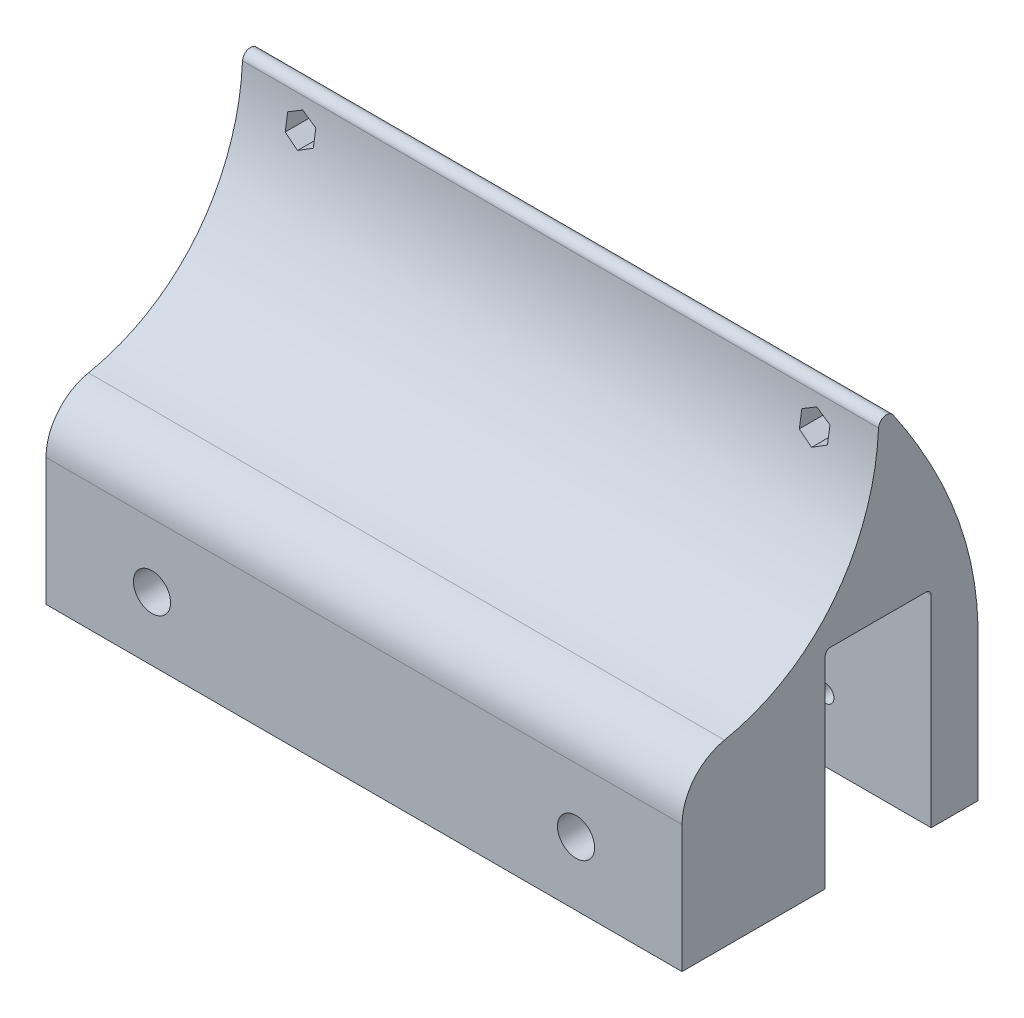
ISO-10303-21;
HEADER;
FILE_DESCRIPTION(('STEP AP214'),'2;1');
FILE_NAME('part.step','',(''),(''),'','','');
FILE_SCHEMA(('AUTOMOTIVE_DESIGN { 1 0 10303 214 1 1 1 1 }'));
ENDSEC;
DATA;
#1=APPLICATION_CONTEXT('core data for automotive mechanical design processes');
#2=APPLICATION_PROTOCOL_DEFINITION('international standard','automotive_design',2000,#1);
#3=PRODUCT_CONTEXT('',#1,'mechanical');
#4=PRODUCT('Part','Part','',(#3));
#5=PRODUCT_RELATED_PRODUCT_CATEGORY('part','',(#4));
#6=PRODUCT_DEFINITION_FORMATION('','',#4);
#7=PRODUCT_DEFINITION_CONTEXT('part definition',#1,'design');
#8=PRODUCT_DEFINITION('design','',#6,#7);
#9=PRODUCT_DEFINITION_SHAPE('','',#8);
#10=(LENGTH_UNIT() NAMED_UNIT(*) SI_UNIT(.MILLI.,.METRE.));
#11=(NAMED_UNIT(*) PLANE_ANGLE_UNIT() SI_UNIT($,.RADIAN.));
#12=(NAMED_UNIT(*) SI_UNIT($,.STERADIAN.) SOLID_ANGLE_UNIT());
#13=UNCERTAINTY_MEASURE_WITH_UNIT(LENGTH_MEASURE(1.E-05),#10,'distance_accuracy_value','');
#14=(GEOMETRIC_REPRESENTATION_CONTEXT(3) GLOBAL_UNCERTAINTY_ASSIGNED_CONTEXT((#13)) GLOBAL_UNIT_ASSIGNED_CONTEXT((#10,
#11,#12)) REPRESENTATION_CONTEXT('',''));
#15=CARTESIAN_POINT('',(0.,0.,0.));
#16=DIRECTION('',(0.,0.,1.));
#17=DIRECTION('',(1.,0.,0.));
#18=AXIS2_PLACEMENT_3D('',#15,#16,#17);
#19=CARTESIAN_POINT('',(51.7500000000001,-7.98751964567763,-59.7915854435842));
#20=DIRECTION('',(0.,0.,1.));
#21=DIRECTION('',(1.,0.,0.));
#22=AXIS2_PLACEMENT_3D('',#19,#20,#21);
#23=CYLINDRICAL_SURFACE('',#22,1.65);
#24=CARTESIAN_POINT('',(51.7500000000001,-7.98751964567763,-25.));
#25=DIRECTION('',(0.,0.,1.));
#26=DIRECTION('',(1.,0.,0.));
#27=AXIS2_PLACEMENT_3D('',#24,#25,#26);
#28=CIRCLE('',#27,1.65);
#29=CARTESIAN_POINT('',(53.4000000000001,-7.98751964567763,-25.));
#30=VERTEX_POINT('',#29);
#31=EDGE_CURVE('E634',#30,#30,#28,.T.);
#32=ORIENTED_EDGE('',*,*,#31,.T.);
#33=EDGE_LOOP('',(#32));
#34=FACE_BOUND('',#33,.T.);
#35=CARTESIAN_POINT('',(51.7500000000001,-7.98751964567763,-27.));
#36=DIRECTION('',(0.,0.,-1.));
#37=DIRECTION('',(-1.,0.,0.));
#38=AXIS2_PLACEMENT_3D('',#35,#36,#37);
#39=CIRCLE('',#38,1.65);
#40=CARTESIAN_POINT('',(50.1000000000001,-7.98751964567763,-27.));
#41=VERTEX_POINT('',#40);
#42=EDGE_CURVE('E1191',#41,#41,#39,.F.);
#43=ORIENTED_EDGE('',*,*,#42,.F.);
#44=EDGE_LOOP('',(#43));
#45=FACE_BOUND('',#44,.T.);
#46=ADVANCED_FACE('F77',(#34,#45),#23,.F.);
#47=CARTESIAN_POINT('',(131.75,-7.98751964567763,-59.7915854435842));
#48=DIRECTION('',(0.,0.,1.));
#49=DIRECTION('',(1.,0.,0.));
#50=AXIS2_PLACEMENT_3D('',#47,#48,#49);
#51=CYLINDRICAL_SURFACE('',#50,1.65000000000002);
#52=CARTESIAN_POINT('',(131.75,-7.98751964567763,-25.));
#53=DIRECTION('',(0.,0.,1.));
#54=DIRECTION('',(1.,0.,0.));
#55=AXIS2_PLACEMENT_3D('',#52,#53,#54);
#56=CIRCLE('',#55,1.65000000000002);
#57=CARTESIAN_POINT('',(133.4,-7.98751964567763,-25.));
#58=VERTEX_POINT('',#57);
#59=EDGE_CURVE('E641',#58,#58,#56,.T.);
#60=ORIENTED_EDGE('',*,*,#59,.T.);
#61=EDGE_LOOP('',(#60));
#62=FACE_BOUND('',#61,.T.);
#63=CARTESIAN_POINT('',(131.75,-7.98751964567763,-27.));
#64=DIRECTION('',(0.,0.,-1.));
#65=DIRECTION('',(-1.,0.,0.));
#66=AXIS2_PLACEMENT_3D('',#63,#64,#65);
#67=CIRCLE('',#66,1.65000000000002);
#68=CARTESIAN_POINT('',(130.1,-7.98751964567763,-27.));
#69=VERTEX_POINT('',#68);
#70=EDGE_CURVE('E1190',#69,#69,#67,.F.);
#71=ORIENTED_EDGE('',*,*,#70,.F.);
#72=EDGE_LOOP('',(#71));
#73=FACE_BOUND('',#72,.T.);
#74=ADVANCED_FACE('F679',(#62,#73),#51,.F.);
#75=CARTESIAN_POINT('',(0.,-20.,0.));
#76=DIRECTION('',(0.,-1.,0.));
#77=DIRECTION('',(0.,0.,-1.));
#78=AXIS2_PLACEMENT_3D('',#75,#76,#77);
#79=PLANE('',#78);
#80=DIRECTION('',(0.,0.,-1.));
#81=VECTOR('',#80,1.);
#82=CARTESIAN_POINT('',(31.7500000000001,-20.,0.));
#83=LINE('',#82,#81);
#84=CARTESIAN_POINT('',(31.7500000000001,-20.,0.));
#85=VERTEX_POINT('',#84);
#86=CARTESIAN_POINT('',(31.7500000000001,-20.,-27.));
#87=VERTEX_POINT('',#86);
#88=EDGE_CURVE('E318',#85,#87,#83,.T.);
#89=ORIENTED_EDGE('',*,*,#88,.T.);
#90=DIRECTION('',(1.,0.,0.));
#91=VECTOR('',#90,1.);
#92=CARTESIAN_POINT('',(0.,-20.,-27.));
#93=LINE('',#92,#91);
#94=CARTESIAN_POINT('',(151.75,-20.,-27.));
#95=VERTEX_POINT('',#94);
#96=EDGE_CURVE('E325',#87,#95,#93,.T.);
#97=ORIENTED_EDGE('',*,*,#96,.T.);
#98=DIRECTION('',(0.,0.,-1.));
#99=VECTOR('',#98,1.);
#100=CARTESIAN_POINT('',(151.75,-20.,0.));
#101=LINE('',#100,#99);
#102=CARTESIAN_POINT('',(151.75,-20.,0.));
#103=VERTEX_POINT('',#102);
#104=EDGE_CURVE('E495',#103,#95,#101,.T.);
#105=ORIENTED_EDGE('',*,*,#104,.F.);
#106=DIRECTION('',(-1.,0.,0.));
#107=VECTOR('',#106,1.);
#108=CARTESIAN_POINT('',(0.,-20.,0.));
#109=LINE('',#108,#107);
#110=EDGE_CURVE('E336',#103,#85,#109,.T.);
#111=ORIENTED_EDGE('',*,*,#110,.T.);
#112=EDGE_LOOP('',(#89,#97,#105,#111));
#113=FACE_BOUND('',#112,.T.);
#114=ADVANCED_FACE('F335',(#113),#79,.T.);
#115=CARTESIAN_POINT('',(31.7500000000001,0.,-175.));
#116=DIRECTION('',(-1.,0.,0.));
#117=DIRECTION('',(0.,-1.,0.));
#118=AXIS2_PLACEMENT_3D('',#115,#116,#117);
#119=PLANE('',#118);
#120=DIRECTION('',(0.,0.,-1.));
#121=VECTOR('',#120,1.);
#122=CARTESIAN_POINT('',(31.7500000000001,19.,0.));
#123=LINE('',#122,#121);
#124=CARTESIAN_POINT('',(31.7500000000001,19.,-28.));
#125=VERTEX_POINT('',#124);
#126=CARTESIAN_POINT('',(31.7500000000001,19.,-46.));
#127=VERTEX_POINT('',#126);
#128=EDGE_CURVE('E670',#125,#127,#123,.T.);
#129=ORIENTED_EDGE('',*,*,#128,.F.);
#130=CARTESIAN_POINT('',(31.7500000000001,18.,-28.));
#131=DIRECTION('',(-1.,0.,0.));
#132=DIRECTION('',(0.,-1.,0.));
#133=AXIS2_PLACEMENT_3D('',#130,#131,#132);
#134=CIRCLE('',#133,1.);
#135=CARTESIAN_POINT('',(31.7500000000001,18.,-27.));
#136=VERTEX_POINT('',#135);
#137=EDGE_CURVE('E12',#125,#136,#134,.F.);
#138=ORIENTED_EDGE('',*,*,#137,.T.);
#139=DIRECTION('',(0.,-1.,0.));
#140=VECTOR('',#139,1.);
#141=CARTESIAN_POINT('',(31.7500000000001,19.,-27.));
#142=LINE('',#141,#140);
#143=EDGE_CURVE('E313',#136,#87,#142,.T.);
#144=ORIENTED_EDGE('',*,*,#143,.T.);
#145=ORIENTED_EDGE('',*,*,#88,.F.);
#146=DIRECTION('',(0.,1.,0.));
#147=VECTOR('',#146,1.);
#148=CARTESIAN_POINT('',(31.75,180.,0.));
#149=LINE('',#148,#147);
#150=CARTESIAN_POINT('',(31.7500000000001,4.02496070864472,0.));
#151=VERTEX_POINT('',#150);
#152=EDGE_CURVE('E424',#85,#151,#149,.T.);
#153=ORIENTED_EDGE('',*,*,#152,.T.);
#154=CARTESIAN_POINT('',(31.7500000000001,4.02496070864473,-9.99999999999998));
#155=DIRECTION('',(-1.,0.,0.));
#156=DIRECTION('',(0.,-1.,0.));
#157=AXIS2_PLACEMENT_3D('',#154,#155,#156);
#158=CIRCLE('',#157,10.);
#159=CARTESIAN_POINT('',(31.7500000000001,13.8250256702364,-8.01034506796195));
#160=VERTEX_POINT('',#159);
#161=EDGE_CURVE('E437',#160,#151,#158,.F.);
#162=ORIENTED_EDGE('',*,*,#161,.F.);
#163=CARTESIAN_POINT('',(31.7500000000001,102.608308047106,-22.5758844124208));
#164=CARTESIAN_POINT('',(31.7500000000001,90.6119505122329,-26.2091481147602));
#165=CARTESIAN_POINT('',(31.7500000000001,49.0425531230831,-48.9065902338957));
#166=CARTESIAN_POINT('',(31.7500000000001,13.2588947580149,-24.3929606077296));
#167=CARTESIAN_POINT('',(31.7500000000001,13.,0.));
#168=B_SPLINE_CURVE_WITH_KNOTS('',3,(#163,#164,#165,#166,#167),.UNSPECIFIED.,.F.,.F.,(4,1,4),
(0.,0.462172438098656,1.),.UNSPECIFIED.);
#169=CARTESIAN_POINT('',(31.7500000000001,50.2766902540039,-37.0726541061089));
#170=VERTEX_POINT('',#169);
#171=EDGE_CURVE('E344',#160,#170,#168,.F.);
#172=ORIENTED_EDGE('',*,*,#171,.T.);
#173=CARTESIAN_POINT('',(31.75,50.2117243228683,-38.5712465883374));
#174=DIRECTION('',(-1.,0.,0.));
#175=DIRECTION('',(0.,-1.,0.));
#176=AXIS2_PLACEMENT_3D('',#173,#174,#175);
#177=CIRCLE('',#176,1.5);
#178=CARTESIAN_POINT('',(31.75,51.0555149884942,-39.8114148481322));
#179=VERTEX_POINT('',#178);
#180=EDGE_CURVE('E356',#170,#179,#177,.T.);
#181=ORIENTED_EDGE('',*,*,#180,.T.);
#182=CARTESIAN_POINT('',(31.7500000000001,4.99999999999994,-55.8132981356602));
#183=CARTESIAN_POINT('',(31.7500000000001,23.6553491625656,-56.5516435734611));
#184=CARTESIAN_POINT('',(31.75,40.4599898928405,-47.5401054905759));
#185=CARTESIAN_POINT('',(31.75,55.,-37.0441127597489));
#186=B_SPLINE_CURVE_WITH_KNOTS('',3,(#182,#183,#184,#185),.UNSPECIFIED.,.F.,.F.,(4,4),(0.,1.),.UNSPECIFIED.);
#187=CARTESIAN_POINT('',(31.7500000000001,4.99999999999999,-55.8132981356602));
#188=VERTEX_POINT('',#187);
#189=EDGE_CURVE('E413',#188,#179,#186,.T.);
#190=ORIENTED_EDGE('',*,*,#189,.F.);
#191=DIRECTION('',(0.,-1.,0.));
#192=VECTOR('',#191,1.);
#193=CARTESIAN_POINT('',(31.7500000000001,4.99999999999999,-55.8132981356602));
#194=LINE('',#193,#192);
#195=CARTESIAN_POINT('',(31.7500000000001,-20.,-55.8132981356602));
#196=VERTEX_POINT('',#195);
#197=EDGE_CURVE('E421',#188,#196,#194,.T.);
#198=ORIENTED_EDGE('',*,*,#197,.T.);
#199=CARTESIAN_POINT('',(31.7500000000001,-20.,-47.));
#200=VERTEX_POINT('',#199);
#201=EDGE_CURVE('E338',#200,#196,#83,.T.);
#202=ORIENTED_EDGE('',*,*,#201,.F.);
#203=DIRECTION('',(0.,-1.,0.));
#204=VECTOR('',#203,1.);
#205=CARTESIAN_POINT('',(31.7500000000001,19.,-47.));
#206=LINE('',#205,#204);
#207=CARTESIAN_POINT('',(31.7500000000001,18.,-47.));
#208=VERTEX_POINT('',#207);
#209=EDGE_CURVE('E321',#208,#200,#206,.T.);
#210=ORIENTED_EDGE('',*,*,#209,.F.);
#211=CARTESIAN_POINT('',(31.7500000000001,18.,-46.));
#212=DIRECTION('',(-1.,0.,0.));
#213=DIRECTION('',(0.,-1.,0.));
#214=AXIS2_PLACEMENT_3D('',#211,#212,#213);
#215=CIRCLE('',#214,1.);
#216=EDGE_CURVE('E663',#208,#127,#215,.F.);
#217=ORIENTED_EDGE('',*,*,#216,.T.);
#218=EDGE_LOOP('',(#129,#138,#144,#145,#153,#162,#172,#181,#190,#198,#202,#210,#217));
#219=FACE_BOUND('',#218,.T.);
#220=ADVANCED_FACE('F315',(#219),#119,.T.);
#221=CARTESIAN_POINT('',(151.75,4.02496070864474,-9.99999999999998));
#222=DIRECTION('',(1.,0.,0.));
#223=DIRECTION('',(0.,1.,0.));
#224=AXIS2_PLACEMENT_3D('',#221,#222,#223);
#225=PLANE('',#224);
#226=ORIENTED_EDGE('',*,*,#104,.T.);
#227=DIRECTION('',(0.,-1.,0.));
#228=VECTOR('',#227,1.);
#229=CARTESIAN_POINT('',(151.75,19.,-27.));
#230=LINE('',#229,#228);
#231=CARTESIAN_POINT('',(151.75,18.,-27.));
#232=VERTEX_POINT('',#231);
#233=EDGE_CURVE('E329',#232,#95,#230,.T.);
#234=ORIENTED_EDGE('',*,*,#233,.F.);
#235=CARTESIAN_POINT('',(151.75,18.,-28.));
#236=DIRECTION('',(1.,0.,0.));
#237=DIRECTION('',(0.,1.,0.));
#238=AXIS2_PLACEMENT_3D('',#235,#236,#237);
#239=CIRCLE('',#238,1.);
#240=CARTESIAN_POINT('',(151.75,19.,-28.));
#241=VERTEX_POINT('',#240);
#242=EDGE_CURVE('E85',#232,#241,#239,.F.);
#243=ORIENTED_EDGE('',*,*,#242,.T.);
#244=DIRECTION('',(0.,0.,1.));
#245=VECTOR('',#244,1.);
#246=CARTESIAN_POINT('',(151.75,19.,0.));
#247=LINE('',#246,#245);
#248=CARTESIAN_POINT('',(151.75,19.,-46.));
#249=VERTEX_POINT('',#248);
#250=EDGE_CURVE('E322',#249,#241,#247,.T.);
#251=ORIENTED_EDGE('',*,*,#250,.F.);
#252=CARTESIAN_POINT('',(151.75,18.,-46.));
#253=DIRECTION('',(1.,0.,0.));
#254=DIRECTION('',(0.,1.,0.));
#255=AXIS2_PLACEMENT_3D('',#252,#253,#254);
#256=CIRCLE('',#255,1.);
#257=CARTESIAN_POINT('',(151.75,18.,-47.));
#258=VERTEX_POINT('',#257);
#259=EDGE_CURVE('E661',#249,#258,#256,.F.);
#260=ORIENTED_EDGE('',*,*,#259,.T.);
#261=DIRECTION('',(0.,-1.,0.));
#262=VECTOR('',#261,1.);
#263=CARTESIAN_POINT('',(151.75,19.,-47.));
#264=LINE('',#263,#262);
#265=CARTESIAN_POINT('',(151.75,-20.,-47.));
#266=VERTEX_POINT('',#265);
#267=EDGE_CURVE('E1279',#258,#266,#264,.T.);
#268=ORIENTED_EDGE('',*,*,#267,.T.);
#269=CARTESIAN_POINT('',(151.75,-20.,-55.8132981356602));
#270=VERTEX_POINT('',#269);
#271=EDGE_CURVE('E496',#266,#270,#101,.T.);
#272=ORIENTED_EDGE('',*,*,#271,.T.);
#273=DIRECTION('',(0.,1.,0.));
#274=VECTOR('',#273,1.);
#275=CARTESIAN_POINT('',(151.75,5.00000000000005,-55.8132981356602));
#276=LINE('',#275,#274);
#277=CARTESIAN_POINT('',(151.75,4.99999999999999,-55.8132981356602));
#278=VERTEX_POINT('',#277);
#279=EDGE_CURVE('E493',#270,#278,#276,.T.);
#280=ORIENTED_EDGE('',*,*,#279,.T.);
#281=CARTESIAN_POINT('',(151.75,4.99999999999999,-55.8132981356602));
#282=CARTESIAN_POINT('',(151.75,5.40320165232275,-55.8292580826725));
#283=CARTESIAN_POINT('',(151.75,5.80656796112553,-55.8406999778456));
#284=CARTESIAN_POINT('',(151.75,6.61345165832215,-55.8545879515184));
#285=CARTESIAN_POINT('',(151.75,7.0169690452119,-55.857034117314));
#286=CARTESIAN_POINT('',(151.75,8.22694670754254,-55.8509425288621));
#287=CARTESIAN_POINT('',(151.75,9.03337805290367,-55.828996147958));
#288=CARTESIAN_POINT('',(151.75,10.6443015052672,-55.7499367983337));
#289=CARTESIAN_POINT('',(151.75,11.4487939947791,-55.692831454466));
#290=CARTESIAN_POINT('',(151.75,13.0483622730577,-55.5449174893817));
#291=CARTESIAN_POINT('',(151.75,13.843462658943,-55.4543742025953));
#292=CARTESIAN_POINT('',(151.75,15.4293839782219,-55.2406018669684));
#293=CARTESIAN_POINT('',(151.75,16.2202041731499,-55.1173673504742));
#294=CARTESIAN_POINT('',(151.75,17.796379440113,-54.839485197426));
#295=CARTESIAN_POINT('',(151.75,18.5817337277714,-54.6848331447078));
#296=CARTESIAN_POINT('',(151.75,20.6784061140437,-54.2300087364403));
#297=CARTESIAN_POINT('',(151.75,21.9838562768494,-53.9024386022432));
#298=CARTESIAN_POINT('',(151.75,24.5732291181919,-53.1696999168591));
#299=CARTESIAN_POINT('',(151.75,25.8571412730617,-52.7644945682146));
#300=CARTESIAN_POINT('',(151.75,28.4008952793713,-51.8841491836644));
#301=CARTESIAN_POINT('',(151.75,29.6607331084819,-51.4089975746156));
#302=CARTESIAN_POINT('',(151.75,32.1618319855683,-50.3935845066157));
#303=CARTESIAN_POINT('',(151.75,33.4029529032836,-49.8529795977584));
#304=CARTESIAN_POINT('',(151.75,35.8590359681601,-48.7161922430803));
#305=CARTESIAN_POINT('',(151.75,37.0740039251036,-48.1200223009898));
#306=CARTESIAN_POINT('',(151.75,39.4784109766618,-46.8789000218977));
#307=CARTESIAN_POINT('',(151.75,40.6678538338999,-46.2339549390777));
#308=CARTESIAN_POINT('',(151.75,43.4269575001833,-44.6725554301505));
#309=CARTESIAN_POINT('',(151.75,44.9869076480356,-43.738924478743));
#310=CARTESIAN_POINT('',(151.75,47.2910094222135,-42.2945985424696));
#311=CARTESIAN_POINT('',(151.75,48.0502983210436,-41.8077454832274));
#312=CARTESIAN_POINT('',(151.75,49.5596671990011,-40.8198545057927));
#313=CARTESIAN_POINT('',(151.75,50.3097465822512,-40.3188156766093));
#314=CARTESIAN_POINT('',(151.75,51.0555149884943,-39.8114148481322));
#315=B_SPLINE_CURVE_WITH_KNOTS('',3,(#281,#282,#283,#284,#285,#286,#287,#288,#289,#290,#291,
#292,#293,#294,#295,#296,#297,#298,#299,#300,#301,#302,#303,#304,#305,#306,#307,#308,#309,#310,
#311,#312,#313,#314),.UNSPECIFIED.,.F.,.F.,(4,2,2,2,2,2,2,2,2,2,2,2,2,2,2,2,4),(0.,
1.21049911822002,2.42098648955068,4.84032473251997,7.25913848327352,9.65915718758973,
12.0595775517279,14.4603355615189,18.495270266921,22.5321221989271,26.5696428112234,
30.629350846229,34.6881475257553,38.7463417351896,44.1982515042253,46.9040362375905,
49.609995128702),.UNSPECIFIED.);
#316=CARTESIAN_POINT('',(151.75,51.0555149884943,-39.8114148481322));
#317=VERTEX_POINT('',#316);
#318=EDGE_CURVE('E489',#278,#317,#315,.T.);
#319=ORIENTED_EDGE('',*,*,#318,.T.);
#320=CARTESIAN_POINT('',(151.75,50.2117243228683,-38.5712465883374));
#321=DIRECTION('',(1.,0.,0.));
#322=DIRECTION('',(0.,1.,0.));
#323=AXIS2_PLACEMENT_3D('',#320,#321,#322);
#324=CIRCLE('',#323,1.50000000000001);
#325=CARTESIAN_POINT('',(151.75,50.2766902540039,-37.0726541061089));
#326=VERTEX_POINT('',#325);
#327=EDGE_CURVE('E470',#317,#326,#324,.T.);
#328=ORIENTED_EDGE('',*,*,#327,.T.);
#329=CARTESIAN_POINT('',(151.75,50.2766902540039,-37.0726541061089));
#330=CARTESIAN_POINT('',(151.75,49.4710092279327,-37.0377310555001));
#331=CARTESIAN_POINT('',(151.75,48.6661076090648,-36.982177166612));
#332=CARTESIAN_POINT('',(151.75,47.0597060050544,-36.8291511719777));
#333=CARTESIAN_POINT('',(151.75,46.2582089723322,-36.7316481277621));
#334=CARTESIAN_POINT('',(151.75,45.0607203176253,-36.5534887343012));
#335=CARTESIAN_POINT('',(151.75,44.66231320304,-36.4887772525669));
#336=CARTESIAN_POINT('',(151.75,43.8672954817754,-36.3486252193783));
#337=CARTESIAN_POINT('',(151.75,43.4706853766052,-36.273181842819));
#338=CARTESIAN_POINT('',(151.75,41.8781804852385,-35.9476709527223));
#339=CARTESIAN_POINT('',(151.75,40.690937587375,-35.6534931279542));
#340=CARTESIAN_POINT('',(151.75,38.3459738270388,-34.9642368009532));
#341=CARTESIAN_POINT('',(151.75,37.1882531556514,-34.5691576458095));
#342=CARTESIAN_POINT('',(151.75,35.4791927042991,-33.8988904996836));
#343=CARTESIAN_POINT('',(151.75,34.9126897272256,-33.6618252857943));
#344=CARTESIAN_POINT('',(151.75,33.7913332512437,-33.1618401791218));
#345=CARTESIAN_POINT('',(151.75,33.2364767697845,-32.8989270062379));
#346=CARTESIAN_POINT('',(151.75,32.1396929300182,-32.3471283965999));
#347=CARTESIAN_POINT('',(151.75,31.5977681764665,-32.0582377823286));
#348=CARTESIAN_POINT('',(151.75,30.5284741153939,-31.4545736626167));
#349=CARTESIAN_POINT('',(151.75,30.0011056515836,-31.1397986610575));
#350=CARTESIAN_POINT('',(151.75,28.9648189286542,-30.4859813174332));
#351=CARTESIAN_POINT('',(151.75,28.4558305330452,-30.1470502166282));
#352=CARTESIAN_POINT('',(151.75,27.4555362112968,-29.4440332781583));
#353=CARTESIAN_POINT('',(151.75,26.9642299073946,-29.0799479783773));
#354=CARTESIAN_POINT('',(151.75,26.0009800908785,-28.3271159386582));
#355=CARTESIAN_POINT('',(151.75,25.5290339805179,-27.9383725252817));
#356=CARTESIAN_POINT('',(151.75,24.6061145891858,-27.1368544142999));
#357=CARTESIAN_POINT('',(151.75,24.1551386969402,-26.7240827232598));
#358=CARTESIAN_POINT('',(151.75,23.2096920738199,-25.8115693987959));
#359=CARTESIAN_POINT('',(151.75,22.7188398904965,-25.3080679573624));
#360=CARTESIAN_POINT('',(151.75,21.7691550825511,-24.2717879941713));
#361=CARTESIAN_POINT('',(151.75,21.3103203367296,-23.7390114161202));
#362=CARTESIAN_POINT('',(151.75,20.4266639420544,-22.6459454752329));
#363=CARTESIAN_POINT('',(151.75,20.0018425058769,-22.0856559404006));
#364=CARTESIAN_POINT('',(151.75,19.1875180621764,-20.9390156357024));
#365=CARTESIAN_POINT('',(151.75,18.7980555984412,-20.352636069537));
#366=CARTESIAN_POINT('',(151.75,18.0564177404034,-19.1567797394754));
#367=CARTESIAN_POINT('',(151.75,17.7042418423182,-18.5473032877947));
#368=CARTESIAN_POINT('',(151.75,17.0382789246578,-17.3079390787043));
#369=CARTESIAN_POINT('',(151.75,16.7244803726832,-16.6780575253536));
#370=CARTESIAN_POINT('',(151.75,16.2330948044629,-15.6116671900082));
#371=CARTESIAN_POINT('',(151.75,16.0447706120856,-15.180064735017));
#372=CARTESIAN_POINT('',(151.75,15.6856312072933,-14.3097296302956));
#373=CARTESIAN_POINT('',(151.75,15.5148123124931,-13.8709985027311));
#374=CARTESIAN_POINT('',(151.75,15.1906425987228,-12.9871590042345));
#375=CARTESIAN_POINT('',(151.75,15.0372910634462,-12.5420508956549));
#376=CARTESIAN_POINT('',(151.75,14.7483955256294,-11.6476056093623));
#377=CARTESIAN_POINT('',(151.75,14.6127982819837,-11.1982856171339));
#378=CARTESIAN_POINT('',(151.75,14.3586936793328,-10.2948289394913));
#379=CARTESIAN_POINT('',(151.75,14.2401869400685,-9.840692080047));
#380=CARTESIAN_POINT('',(151.75,14.020029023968,-8.92837442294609));
#381=CARTESIAN_POINT('',(151.75,13.9183769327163,-8.47019384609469));
#382=CARTESIAN_POINT('',(151.75,13.8250256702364,-8.010345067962));
#383=B_SPLINE_CURVE_WITH_KNOTS('',3,(#329,#330,#331,#332,#333,#334,#335,#336,#337,#338,#339,
#340,#341,#342,#343,#344,#345,#346,#347,#348,#349,#350,#351,#352,#353,#354,#355,#356,#357,#358,
#359,#360,#361,#362,#363,#364,#365,#366,#367,#368,#369,#370,#371,#372,#373,#374,#375,#376,#377,
#378,#379,#380,#381,#382),.UNSPECIFIED.,.F.,.F.,(4,2,2,2,2,2,2,2,2,2,2,2,2,2,2,2,2,2,2,2,2,2,2,
2,2,2,4),(0.,2.41925505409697,4.84029743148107,6.05104515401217,7.26211219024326,
10.9268710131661,14.5916535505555,16.4334204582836,18.2747098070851,20.1163669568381,
21.9581306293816,23.7919015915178,25.6256333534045,27.4591182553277,29.2923742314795,
31.4005350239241,33.5085560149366,35.6165901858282,37.7270117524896,39.8374048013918,
41.9471621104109,43.3595130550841,44.7715662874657,46.183561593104,47.5912206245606,
48.9989306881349,50.406564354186),.UNSPECIFIED.);
#384=CARTESIAN_POINT('',(151.75,13.8250256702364,-8.010345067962));
#385=VERTEX_POINT('',#384);
#386=EDGE_CURVE('E459',#326,#385,#383,.T.);
#387=ORIENTED_EDGE('',*,*,#386,.T.);
#388=CARTESIAN_POINT('',(151.75,4.02496070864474,-9.99999999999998));
#389=DIRECTION('',(1.,0.,0.));
#390=DIRECTION('',(0.,1.,0.));
#391=AXIS2_PLACEMENT_3D('',#388,#389,#390);
#392=CIRCLE('',#391,10.);
#393=CARTESIAN_POINT('',(151.75,4.02496070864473,0.));
#394=VERTEX_POINT('',#393);
#395=EDGE_CURVE('E466',#385,#394,#392,.T.);
#396=ORIENTED_EDGE('',*,*,#395,.T.);
#397=DIRECTION('',(0.,-1.,0.));
#398=VECTOR('',#397,1.);
#399=CARTESIAN_POINT('',(151.75,-20.,0.));
#400=LINE('',#399,#398);
#401=EDGE_CURVE('E499',#394,#103,#400,.T.);
#402=ORIENTED_EDGE('',*,*,#401,.T.);
#403=EDGE_LOOP('',(#226,#234,#243,#251,#260,#268,#272,#280,#319,#328,#387,#396,#402));
#404=FACE_BOUND('',#403,.T.);
#405=ADVANCED_FACE('F464',(#404),#225,.T.);
#406=CARTESIAN_POINT('',(51.7500000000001,-7.98751964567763,-47.));
#407=DIRECTION('',(0.,0.,-1.));
#408=DIRECTION('',(-1.,0.,0.));
#409=AXIS2_PLACEMENT_3D('',#406,#407,#408);
#410=CIRCLE('',#409,1.65);
#411=CARTESIAN_POINT('',(50.1000000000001,-7.98751964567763,-47.));
#412=VERTEX_POINT('',#411);
#413=EDGE_CURVE('E700',#412,#412,#410,.F.);
#414=ORIENTED_EDGE('',*,*,#413,.T.);
#415=EDGE_LOOP('',(#414));
#416=FACE_BOUND('',#415,.T.);
#417=CARTESIAN_POINT('',(51.7500000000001,-7.98751964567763,-50.8132981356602));
#418=DIRECTION('',(0.,0.,-1.));
#419=DIRECTION('',(0.,1.,0.));
#420=AXIS2_PLACEMENT_3D('',#417,#418,#419);
#421=CIRCLE('',#420,1.65);
#422=CARTESIAN_POINT('',(51.7500000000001,-6.33751964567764,-50.8132981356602));
#423=VERTEX_POINT('',#422);
#424=EDGE_CURVE('E648',#423,#423,#421,.F.);
#425=ORIENTED_EDGE('',*,*,#424,.F.);
#426=EDGE_LOOP('',(#425));
#427=FACE_BOUND('',#426,.T.);
#428=ADVANCED_FACE('F485',(#416,#427),#23,.F.);
#429=CARTESIAN_POINT('',(131.75,-7.98751964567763,-47.));
#430=DIRECTION('',(0.,0.,-1.));
#431=DIRECTION('',(-1.,0.,0.));
#432=AXIS2_PLACEMENT_3D('',#429,#430,#431);
#433=CIRCLE('',#432,1.65000000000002);
#434=CARTESIAN_POINT('',(130.1,-7.98751964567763,-47.));
#435=VERTEX_POINT('',#434);
#436=EDGE_CURVE('E1196',#435,#435,#433,.F.);
#437=ORIENTED_EDGE('',*,*,#436,.T.);
#438=EDGE_LOOP('',(#437));
#439=FACE_BOUND('',#438,.T.);
#440=CARTESIAN_POINT('',(131.75,-7.98751964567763,-50.8132981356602));
#441=DIRECTION('',(0.,0.,-1.));
#442=DIRECTION('',(0.,1.,0.));
#443=AXIS2_PLACEMENT_3D('',#440,#441,#442);
#444=CIRCLE('',#443,1.65000000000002);
#445=CARTESIAN_POINT('',(131.75,-6.33751964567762,-50.8132981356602));
#446=VERTEX_POINT('',#445);
#447=EDGE_CURVE('E644',#446,#446,#444,.F.);
#448=ORIENTED_EDGE('',*,*,#447,.F.);
#449=EDGE_LOOP('',(#448));
#450=FACE_BOUND('',#449,.T.);
#451=ADVANCED_FACE('F687',(#439,#450),#51,.F.);
#452=DIRECTION('',(1.,0.,0.));
#453=VECTOR('',#452,1.);
#454=CARTESIAN_POINT('',(0.,-20.,-47.));
#455=LINE('',#454,#453);
#456=EDGE_CURVE('E333',#200,#266,#455,.T.);
#457=ORIENTED_EDGE('',*,*,#456,.F.);
#458=ORIENTED_EDGE('',*,*,#201,.T.);
#459=DIRECTION('',(-1.,0.,0.));
#460=VECTOR('',#459,1.);
#461=CARTESIAN_POINT('',(113.25,-20.,-55.8132981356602));
#462=LINE('',#461,#460);
#463=EDGE_CURVE('E422',#270,#196,#462,.T.);
#464=ORIENTED_EDGE('',*,*,#463,.F.);
#465=ORIENTED_EDGE('',*,*,#271,.F.);
#466=EDGE_LOOP('',(#457,#458,#464,#465));
#467=FACE_BOUND('',#466,.T.);
#468=ADVANCED_FACE('F695',(#467),#79,.T.);
#469=CARTESIAN_POINT('',(0.,180.,0.));
#470=DIRECTION('',(0.,0.,-1.));
#471=DIRECTION('',(-1.,0.,0.));
#472=AXIS2_PLACEMENT_3D('',#469,#470,#471);
#473=PLANE('',#472);
#474=CARTESIAN_POINT('',(131.75,-7.98751964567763,0.));
#475=DIRECTION('',(0.,0.,1.));
#476=DIRECTION('',(1.,0.,0.));
#477=AXIS2_PLACEMENT_3D('',#474,#475,#476);
#478=CIRCLE('',#477,3.49999999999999);
#479=CARTESIAN_POINT('',(135.25,-7.98751964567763,0.));
#480=VERTEX_POINT('',#479);
#481=EDGE_CURVE('E640',#480,#480,#478,.T.);
#482=ORIENTED_EDGE('',*,*,#481,.F.);
#483=EDGE_LOOP('',(#482));
#484=FACE_BOUND('',#483,.T.);
#485=CARTESIAN_POINT('',(51.7500000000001,-7.98751964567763,0.));
#486=DIRECTION('',(0.,0.,1.));
#487=DIRECTION('',(1.,0.,0.));
#488=AXIS2_PLACEMENT_3D('',#485,#486,#487);
#489=CIRCLE('',#488,3.5);
#490=CARTESIAN_POINT('',(55.2500000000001,-7.98751964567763,0.));
#491=VERTEX_POINT('',#490);
#492=EDGE_CURVE('E813',#491,#491,#489,.T.);
#493=ORIENTED_EDGE('',*,*,#492,.F.);
#494=EDGE_LOOP('',(#493));
#495=FACE_BOUND('',#494,.T.);
#496=ORIENTED_EDGE('',*,*,#110,.F.);
#497=ORIENTED_EDGE('',*,*,#401,.F.);
#498=DIRECTION('',(-1.,0.,0.));
#499=VECTOR('',#498,1.);
#500=CARTESIAN_POINT('',(0.,4.02496070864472,0.));
#501=LINE('',#500,#499);
#502=EDGE_CURVE('E337',#394,#151,#501,.T.);
#503=ORIENTED_EDGE('',*,*,#502,.T.);
#504=ORIENTED_EDGE('',*,*,#152,.F.);
#505=EDGE_LOOP('',(#496,#497,#503,#504));
#506=FACE_BOUND('',#505,.T.);
#507=ADVANCED_FACE('F401',(#484,#495,#506),#473,.F.);
#508=CARTESIAN_POINT('',(195.,102.608308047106,-22.5758844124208));
#509=CARTESIAN_POINT('',(195.,90.6119505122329,-26.2091481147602));
#510=CARTESIAN_POINT('',(195.,49.0425531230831,-48.9065902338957));
#511=CARTESIAN_POINT('',(195.,13.2588947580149,-24.3929606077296));
#512=CARTESIAN_POINT('',(195.,13.,0.));
#513=B_SPLINE_CURVE_WITH_KNOTS('',3,(#508,#509,#510,#511,#512),.UNSPECIFIED.,.F.,.F.,(4,1,4),
(0.,0.462172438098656,1.),.UNSPECIFIED.);
#514=DIRECTION('',(-1.,0.,0.));
#515=VECTOR('',#514,1.);
#516=SURFACE_OF_LINEAR_EXTRUSION('',#513,#515);
#517=CARTESIAN_POINT('',(140.25,48.059956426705,-36.9240125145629));
#518=CARTESIAN_POINT('',(140.691866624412,47.8048446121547,-36.9008203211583));
#519=CARTESIAN_POINT('',(141.133633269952,47.5497905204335,-36.8754854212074));
#520=CARTESIAN_POINT('',(142.016966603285,47.0397977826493,-36.8205302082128));
#521=CARTESIAN_POINT('',(142.458533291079,46.7848591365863,-36.7909098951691));
#522=CARTESIAN_POINT('',(142.9,46.5299782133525,-36.7591468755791));
#523=B_SPLINE_CURVE_WITH_KNOTS('',3,(#517,#518,#519,#520,#521,#522),.UNSPECIFIED.,.F.,.F.,(4,2,
4),(0.,1.53221080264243,3.06442160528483),.UNSPECIFIED.);
#524=CARTESIAN_POINT('',(140.25,48.059956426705,-36.9240125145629));
#525=VERTEX_POINT('',#524);
#526=CARTESIAN_POINT('',(142.9,46.5299782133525,-36.7591468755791));
#527=VERTEX_POINT('',#526);
#528=EDGE_CURVE('E569',#525,#527,#523,.T.);
#529=ORIENTED_EDGE('',*,*,#528,.T.);
#530=CARTESIAN_POINT('',(142.9,102.608308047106,-22.5758844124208));
#531=CARTESIAN_POINT('',(142.9,90.6119505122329,-26.2091481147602));
#532=CARTESIAN_POINT('',(142.9,49.0425531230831,-48.9065902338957));
#533=CARTESIAN_POINT('',(142.9,13.2588947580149,-24.3929606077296));
#534=CARTESIAN_POINT('',(142.9,13.,0.));
#535=B_SPLINE_CURVE_WITH_KNOTS('',3,(#530,#531,#532,#533,#534),.UNSPECIFIED.,.F.,.F.,(4,1,4),
(0.,0.462172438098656,1.),.UNSPECIFIED.);
#536=CARTESIAN_POINT('',(142.9,43.4700217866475,-36.2711831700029));
#537=VERTEX_POINT('',#536);
#538=EDGE_CURVE('E841',#527,#537,#535,.T.);
#539=ORIENTED_EDGE('',*,*,#538,.T.);
#540=CARTESIAN_POINT('',(142.9,43.4700217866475,-36.2711831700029));
#541=CARTESIAN_POINT('',(142.457902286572,43.2147765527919,-36.2214401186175));
#542=CARTESIAN_POINT('',(142.016020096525,42.959655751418,-36.169364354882));
#543=CARTESIAN_POINT('',(141.132686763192,42.4496630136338,-36.0605474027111));
#544=CARTESIAN_POINT('',(140.691235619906,42.1947910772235,-36.0038062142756));
#545=CARTESIAN_POINT('',(140.25,41.940043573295,-35.9447323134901));
#546=B_SPLINE_CURVE_WITH_KNOTS('',3,(#540,#541,#542,#543,#544,#545),.UNSPECIFIED.,.F.,.F.,(4,2,
4),(0.,1.5386765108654,3.07735302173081),.UNSPECIFIED.);
#547=CARTESIAN_POINT('',(140.25,41.940043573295,-35.9447323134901));
#548=VERTEX_POINT('',#547);
#549=EDGE_CURVE('E600',#537,#548,#546,.T.);
#550=ORIENTED_EDGE('',*,*,#549,.T.);
#551=CARTESIAN_POINT('',(140.25,41.940043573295,-35.9447323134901));
#552=CARTESIAN_POINT('',(139.808764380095,42.1947910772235,-36.0038062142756));
#553=CARTESIAN_POINT('',(139.367313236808,42.4496630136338,-36.0605474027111));
#554=CARTESIAN_POINT('',(138.483979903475,42.959655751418,-36.169364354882));
#555=CARTESIAN_POINT('',(138.042097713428,43.2147765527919,-36.2214401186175));
#556=CARTESIAN_POINT('',(137.6,43.4700217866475,-36.2711831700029));
#557=B_SPLINE_CURVE_WITH_KNOTS('',3,(#551,#552,#553,#554,#555,#556),.UNSPECIFIED.,.F.,.F.,(4,2,
4),(0.,1.53867651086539,3.07735302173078),.UNSPECIFIED.);
#558=CARTESIAN_POINT('',(137.6,43.4700217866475,-36.2711831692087));
#559=VERTEX_POINT('',#558);
#560=EDGE_CURVE('E590',#548,#559,#557,.T.);
#561=ORIENTED_EDGE('',*,*,#560,.T.);
#562=CARTESIAN_POINT('',(137.6,102.608308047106,-22.5758844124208));
#563=CARTESIAN_POINT('',(137.6,90.6119505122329,-26.2091481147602));
#564=CARTESIAN_POINT('',(137.6,49.0425531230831,-48.9065902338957));
#565=CARTESIAN_POINT('',(137.6,13.2588947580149,-24.3929606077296));
#566=CARTESIAN_POINT('',(137.6,13.,0.));
#567=B_SPLINE_CURVE_WITH_KNOTS('',3,(#562,#563,#564,#565,#566),.UNSPECIFIED.,.F.,.F.,(4,1,4),
(0.,0.462172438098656,1.),.UNSPECIFIED.);
#568=CARTESIAN_POINT('',(137.6,46.5299782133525,-36.7591468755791));
#569=VERTEX_POINT('',#568);
#570=EDGE_CURVE('E585',#559,#569,#567,.F.);
#571=ORIENTED_EDGE('',*,*,#570,.T.);
#572=CARTESIAN_POINT('',(137.6,46.5299782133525,-36.7591468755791));
#573=CARTESIAN_POINT('',(138.041466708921,46.7848591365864,-36.7909098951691));
#574=CARTESIAN_POINT('',(138.483033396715,47.0397977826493,-36.8205302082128));
#575=CARTESIAN_POINT('',(139.366366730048,47.5497905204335,-36.8754854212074));
#576=CARTESIAN_POINT('',(139.808133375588,47.8048446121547,-36.9008203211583));
#577=CARTESIAN_POINT('',(140.25,48.0599564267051,-36.9240125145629));
#578=B_SPLINE_CURVE_WITH_KNOTS('',3,(#572,#573,#574,#575,#576,#577),.UNSPECIFIED.,.F.,.F.,(4,2,
4),(0.,1.53221080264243,3.0644216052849),.UNSPECIFIED.);
#579=EDGE_CURVE('E576',#569,#525,#578,.T.);
#580=ORIENTED_EDGE('',*,*,#579,.T.);
#581=EDGE_LOOP('',(#529,#539,#550,#561,#571,#580));
#582=FACE_BOUND('',#581,.T.);
#583=CARTESIAN_POINT('',(43.2500000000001,48.059956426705,-36.9240125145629));
#584=CARTESIAN_POINT('',(43.6918666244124,47.8048446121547,-36.9008203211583));
#585=CARTESIAN_POINT('',(44.1336332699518,47.5497905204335,-36.8754854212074));
#586=CARTESIAN_POINT('',(45.0169666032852,47.0397977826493,-36.8205302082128));
#587=CARTESIAN_POINT('',(45.458533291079,46.7848591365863,-36.7909098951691));
#588=CARTESIAN_POINT('',(45.9000000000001,46.5299782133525,-36.7591468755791));
#589=B_SPLINE_CURVE_WITH_KNOTS('',3,(#583,#584,#585,#586,#587,#588),.UNSPECIFIED.,.F.,.F.,(4,2,
4),(0.,1.53221080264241,3.06442160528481),.UNSPECIFIED.);
#590=CARTESIAN_POINT('',(43.2500000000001,48.059956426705,-36.9240125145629));
#591=VERTEX_POINT('',#590);
#592=CARTESIAN_POINT('',(45.9000000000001,46.5299782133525,-36.7591468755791));
#593=VERTEX_POINT('',#592);
#594=EDGE_CURVE('E380',#591,#593,#589,.T.);
#595=ORIENTED_EDGE('',*,*,#594,.T.);
#596=CARTESIAN_POINT('',(45.9000000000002,102.608308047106,-22.5758844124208));
#597=CARTESIAN_POINT('',(45.9000000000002,90.6119505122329,-26.2091481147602));
#598=CARTESIAN_POINT('',(45.9000000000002,49.0425531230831,-48.9065902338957));
#599=CARTESIAN_POINT('',(45.9000000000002,13.2588947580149,-24.3929606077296));
#600=CARTESIAN_POINT('',(45.9000000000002,13.,0.));
#601=B_SPLINE_CURVE_WITH_KNOTS('',3,(#596,#597,#598,#599,#600),.UNSPECIFIED.,.F.,.F.,(4,1,4),
(0.,0.462172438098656,1.),.UNSPECIFIED.);
#602=CARTESIAN_POINT('',(45.9000000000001,43.4700217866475,-36.2711831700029));
#603=VERTEX_POINT('',#602);
#604=EDGE_CURVE('E501',#593,#603,#601,.T.);
#605=ORIENTED_EDGE('',*,*,#604,.T.);
#606=CARTESIAN_POINT('',(45.9000000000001,43.4700217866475,-36.2711831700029));
#607=CARTESIAN_POINT('',(45.4579022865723,43.2147765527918,-36.2214401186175));
#608=CARTESIAN_POINT('',(45.0160200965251,42.9596557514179,-36.169364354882));
#609=CARTESIAN_POINT('',(44.1326867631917,42.4496630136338,-36.0605474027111));
#610=CARTESIAN_POINT('',(43.6912356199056,42.1947910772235,-36.0038062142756));
#611=CARTESIAN_POINT('',(43.2500000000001,41.940043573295,-35.9447323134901));
#612=B_SPLINE_CURVE_WITH_KNOTS('',3,(#606,#607,#608,#609,#610,#611),.UNSPECIFIED.,.F.,.F.,(4,2,
4),(0.,1.5386765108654,3.07735302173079),.UNSPECIFIED.);
#613=CARTESIAN_POINT('',(43.2500000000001,41.940043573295,-35.9447323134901));
#614=VERTEX_POINT('',#613);
#615=EDGE_CURVE('E506',#603,#614,#612,.T.);
#616=ORIENTED_EDGE('',*,*,#615,.T.);
#617=CARTESIAN_POINT('',(43.2500000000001,41.940043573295,-35.9447323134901));
#618=CARTESIAN_POINT('',(42.8087643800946,42.1947910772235,-36.0038062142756));
#619=CARTESIAN_POINT('',(42.3673132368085,42.4496630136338,-36.0605474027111));
#620=CARTESIAN_POINT('',(41.4839799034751,42.9596557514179,-36.169364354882));
#621=CARTESIAN_POINT('',(41.0420977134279,43.2147765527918,-36.2214401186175));
#622=CARTESIAN_POINT('',(40.6000000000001,43.4700217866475,-36.2711831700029));
#623=B_SPLINE_CURVE_WITH_KNOTS('',3,(#617,#618,#619,#620,#621,#622),.UNSPECIFIED.,.F.,.F.,(4,2,
4),(0.,1.53867651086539,3.07735302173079),.UNSPECIFIED.);
#624=CARTESIAN_POINT('',(40.6000000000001,43.4700217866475,-36.2711831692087));
#625=VERTEX_POINT('',#624);
#626=EDGE_CURVE('E516',#614,#625,#623,.T.);
#627=ORIENTED_EDGE('',*,*,#626,.T.);
#628=CARTESIAN_POINT('',(40.6000000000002,102.608308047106,-22.5758844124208));
#629=CARTESIAN_POINT('',(40.6000000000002,90.6119505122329,-26.2091481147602));
#630=CARTESIAN_POINT('',(40.6000000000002,49.0425531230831,-48.9065902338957));
#631=CARTESIAN_POINT('',(40.6000000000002,13.2588947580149,-24.3929606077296));
#632=CARTESIAN_POINT('',(40.6000000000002,13.,0.));
#633=B_SPLINE_CURVE_WITH_KNOTS('',3,(#628,#629,#630,#631,#632),.UNSPECIFIED.,.F.,.F.,(4,1,4),
(0.,0.462172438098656,1.),.UNSPECIFIED.);
#634=CARTESIAN_POINT('',(40.6000000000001,46.5299782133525,-36.7591468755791));
#635=VERTEX_POINT('',#634);
#636=EDGE_CURVE('E1372',#625,#635,#633,.F.);
#637=ORIENTED_EDGE('',*,*,#636,.T.);
#638=CARTESIAN_POINT('',(40.6000000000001,46.5299782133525,-36.7591468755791));
#639=CARTESIAN_POINT('',(41.0414667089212,46.7848591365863,-36.7909098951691));
#640=CARTESIAN_POINT('',(41.483033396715,47.0397977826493,-36.8205302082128));
#641=CARTESIAN_POINT('',(42.3663667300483,47.5497905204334,-36.8754854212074));
#642=CARTESIAN_POINT('',(42.8081333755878,47.8048446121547,-36.9008203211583));
#643=CARTESIAN_POINT('',(43.2500000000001,48.059956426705,-36.9240125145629));
#644=B_SPLINE_CURVE_WITH_KNOTS('',3,(#638,#639,#640,#641,#642,#643),.UNSPECIFIED.,.F.,.F.,(4,2,
4),(0.,1.5322108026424,3.06442160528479),.UNSPECIFIED.);
#645=EDGE_CURVE('E387',#635,#591,#644,.T.);
#646=ORIENTED_EDGE('',*,*,#645,.T.);
#647=EDGE_LOOP('',(#595,#605,#616,#627,#637,#646));
#648=FACE_BOUND('',#647,.T.);
#649=DIRECTION('',(-1.,0.,0.));
#650=VECTOR('',#649,1.);
#651=CARTESIAN_POINT('',(0.,13.8250256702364,-8.010345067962));
#652=LINE('',#651,#650);
#653=EDGE_CURVE('E340',#160,#385,#652,.F.);
#654=ORIENTED_EDGE('',*,*,#653,.T.);
#655=ORIENTED_EDGE('',*,*,#386,.F.);
#656=DIRECTION('',(-1.,0.,0.));
#657=VECTOR('',#656,1.);
#658=CARTESIAN_POINT('',(128.25,50.2766902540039,-37.0726541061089));
#659=LINE('',#658,#657);
#660=EDGE_CURVE('E435',#326,#170,#659,.T.);
#661=ORIENTED_EDGE('',*,*,#660,.T.);
#662=ORIENTED_EDGE('',*,*,#171,.F.);
#663=EDGE_LOOP('',(#654,#655,#661,#662));
#664=FACE_BOUND('',#663,.T.);
#665=ADVANCED_FACE('F395',(#582,#648,#664),#516,.F.);
#666=CARTESIAN_POINT('',(80.,4.02496070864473,-9.99999999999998));
#667=DIRECTION('',(-1.,0.,0.));
#668=DIRECTION('',(0.,0.,1.));
#669=AXIS2_PLACEMENT_3D('',#666,#667,#668);
#670=CYLINDRICAL_SURFACE('',#669,10.);
#671=ORIENTED_EDGE('',*,*,#502,.F.);
#672=ORIENTED_EDGE('',*,*,#395,.F.);
#673=ORIENTED_EDGE('',*,*,#653,.F.);
#674=ORIENTED_EDGE('',*,*,#161,.T.);
#675=EDGE_LOOP('',(#671,#672,#673,#674));
#676=FACE_BOUND('',#675,.T.);
#677=ADVANCED_FACE('F400',(#676),#670,.T.);
#678=CARTESIAN_POINT('',(-67.6523792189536,4.9999999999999,-55.8132981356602));
#679=CARTESIAN_POINT('',(-67.6523792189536,23.6553491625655,-56.5516435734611));
#680=CARTESIAN_POINT('',(-67.6523792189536,40.4599898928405,-47.5401054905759));
#681=CARTESIAN_POINT('',(-67.6523792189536,55.,-37.0441127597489));
#682=B_SPLINE_CURVE_WITH_KNOTS('',3,(#678,#679,#680,#681),.UNSPECIFIED.,.F.,.F.,(4,4),(0.,1.),.UNSPECIFIED.);
#683=DIRECTION('',(1.,0.,0.));
#684=VECTOR('',#683,1.);
#685=SURFACE_OF_LINEAR_EXTRUSION('',#682,#684);
#686=CARTESIAN_POINT('',(142.9,4.99999999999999,-55.8132981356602));
#687=CARTESIAN_POINT('',(142.9,23.6553491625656,-56.5516435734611));
#688=CARTESIAN_POINT('',(142.9,40.4599898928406,-47.5401054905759));
#689=CARTESIAN_POINT('',(142.9,55.,-37.0441127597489));
#690=B_SPLINE_CURVE_WITH_KNOTS('',3,(#686,#687,#688,#689),.UNSPECIFIED.,.F.,.F.,(4,4),(0.,1.),.UNSPECIFIED.);
#691=CARTESIAN_POINT('',(142.9,46.5299782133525,-42.7716508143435));
#692=VERTEX_POINT('',#691);
#693=CARTESIAN_POINT('',(142.9,43.4700217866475,-44.6304432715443));
#694=VERTEX_POINT('',#693);
#695=EDGE_CURVE('E629',#692,#694,#690,.F.);
#696=ORIENTED_EDGE('',*,*,#695,.F.);
#697=CARTESIAN_POINT('',(140.25,48.059956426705,-41.798121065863));
#698=CARTESIAN_POINT('',(140.691069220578,47.8053049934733,-41.9625443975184));
#699=CARTESIAN_POINT('',(141.1324371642,47.5504810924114,-42.1258835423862));
#700=CARTESIAN_POINT('',(142.015770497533,47.0404883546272,-42.4503934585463));
#701=CARTESIAN_POINT('',(142.457735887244,46.785319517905,-42.6115642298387));
#702=CARTESIAN_POINT('',(142.9,46.5299782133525,-42.7716508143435));
#703=B_SPLINE_CURVE_WITH_KNOTS('',3,(#697,#698,#699,#700,#701,#702),.UNSPECIFIED.,.F.,.F.,(4,2,
4),(0.,1.60554820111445,3.21109640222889),.UNSPECIFIED.);
#704=CARTESIAN_POINT('',(140.25,48.059956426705,-41.798121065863));
#705=VERTEX_POINT('',#704);
#706=EDGE_CURVE('E545',#705,#692,#703,.T.);
#707=ORIENTED_EDGE('',*,*,#706,.F.);
#708=CARTESIAN_POINT('',(137.6,46.5299782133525,-42.7716508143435));
#709=CARTESIAN_POINT('',(138.042264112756,46.785319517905,-42.6115642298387));
#710=CARTESIAN_POINT('',(138.484229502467,47.0404883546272,-42.4503934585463));
#711=CARTESIAN_POINT('',(139.3675628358,47.5504810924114,-42.1258835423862));
#712=CARTESIAN_POINT('',(139.808930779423,47.8053049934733,-41.9625443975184));
#713=CARTESIAN_POINT('',(140.25,48.059956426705,-41.798121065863));
#714=B_SPLINE_CURVE_WITH_KNOTS('',3,(#708,#709,#710,#711,#712,#713),.UNSPECIFIED.,.F.,.F.,(4,2,
4),(0.,1.60554820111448,3.21109640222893),.UNSPECIFIED.);
#715=CARTESIAN_POINT('',(137.6,46.5299782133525,-42.7716508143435));
#716=VERTEX_POINT('',#715);
#717=EDGE_CURVE('E553',#716,#705,#714,.T.);
#718=ORIENTED_EDGE('',*,*,#717,.F.);
#719=CARTESIAN_POINT('',(137.6,4.99999999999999,-55.8132981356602));
#720=CARTESIAN_POINT('',(137.6,23.6553491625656,-56.5516435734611));
#721=CARTESIAN_POINT('',(137.6,40.4599898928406,-47.5401054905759));
#722=CARTESIAN_POINT('',(137.6,55.,-37.0441127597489));
#723=B_SPLINE_CURVE_WITH_KNOTS('',3,(#719,#720,#721,#722),.UNSPECIFIED.,.F.,.F.,(4,4),(0.,1.),.UNSPECIFIED.);
#724=CARTESIAN_POINT('',(137.6,43.4700217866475,-44.6304432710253));
#725=VERTEX_POINT('',#724);
#726=EDGE_CURVE('E622',#725,#716,#723,.T.);
#727=ORIENTED_EDGE('',*,*,#726,.F.);
#728=CARTESIAN_POINT('',(140.25,41.940043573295,-45.5139511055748));
#729=CARTESIAN_POINT('',(139.807731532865,42.1953873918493,-45.3691065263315));
#730=CARTESIAN_POINT('',(139.365763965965,42.4505574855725,-45.223058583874));
#731=CARTESIAN_POINT('',(138.482430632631,42.9605502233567,-44.9285559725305));
#732=CARTESIAN_POINT('',(138.041064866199,43.2153728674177,-44.7801013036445));
#733=CARTESIAN_POINT('',(137.6,43.4700217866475,-44.6304432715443));
#734=B_SPLINE_CURVE_WITH_KNOTS('',3,(#728,#729,#730,#731,#732,#733),.UNSPECIFIED.,.F.,.F.,(4,2,
4),(0.,1.59248044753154,3.18496089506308),.UNSPECIFIED.);
#735=CARTESIAN_POINT('',(140.25,41.940043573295,-45.5139511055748));
#736=VERTEX_POINT('',#735);
#737=EDGE_CURVE('E616',#736,#725,#734,.T.);
#738=ORIENTED_EDGE('',*,*,#737,.F.);
#739=CARTESIAN_POINT('',(142.9,43.4700217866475,-44.6304432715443));
#740=CARTESIAN_POINT('',(142.458935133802,43.2153728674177,-44.7801013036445));
#741=CARTESIAN_POINT('',(142.017569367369,42.9605502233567,-44.9285559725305));
#742=CARTESIAN_POINT('',(141.134236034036,42.4505574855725,-45.223058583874));
#743=CARTESIAN_POINT('',(140.692268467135,42.1953873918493,-45.3691065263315));
#744=CARTESIAN_POINT('',(140.25,41.940043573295,-45.5139511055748));
#745=B_SPLINE_CURVE_WITH_KNOTS('',3,(#739,#740,#741,#742,#743,#744),.UNSPECIFIED.,.F.,.F.,(4,2,
4),(0.,1.59248044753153,3.1849608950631),.UNSPECIFIED.);
#746=EDGE_CURVE('E621',#694,#736,#745,.T.);
#747=ORIENTED_EDGE('',*,*,#746,.F.);
#748=EDGE_LOOP('',(#696,#707,#718,#727,#738,#747));
#749=FACE_BOUND('',#748,.T.);
#750=CARTESIAN_POINT('',(45.9000000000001,4.99999999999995,-55.8132981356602));
#751=CARTESIAN_POINT('',(45.9000000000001,23.6553491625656,-56.5516435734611));
#752=CARTESIAN_POINT('',(45.9000000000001,40.4599898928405,-47.5401054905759));
#753=CARTESIAN_POINT('',(45.9000000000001,55.,-37.0441127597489));
#754=B_SPLINE_CURVE_WITH_KNOTS('',3,(#750,#751,#752,#753),.UNSPECIFIED.,.F.,.F.,(4,4),(0.,1.),.UNSPECIFIED.);
#755=CARTESIAN_POINT('',(45.9000000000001,46.5299782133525,-42.7716508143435));
#756=VERTEX_POINT('',#755);
#757=CARTESIAN_POINT('',(45.9000000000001,43.4700217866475,-44.6304432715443));
#758=VERTEX_POINT('',#757);
#759=EDGE_CURVE('E537',#756,#758,#754,.F.);
#760=ORIENTED_EDGE('',*,*,#759,.F.);
#761=CARTESIAN_POINT('',(43.2500000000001,48.059956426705,-41.798121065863));
#762=CARTESIAN_POINT('',(43.6910692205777,47.8053049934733,-41.9625443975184));
#763=CARTESIAN_POINT('',(44.1324371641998,47.5504810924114,-42.1258835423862));
#764=CARTESIAN_POINT('',(45.0157704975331,47.0404883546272,-42.4503934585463));
#765=CARTESIAN_POINT('',(45.4577358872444,46.7853195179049,-42.6115642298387));
#766=CARTESIAN_POINT('',(45.9000000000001,46.5299782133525,-42.7716508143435));
#767=B_SPLINE_CURVE_WITH_KNOTS('',3,(#761,#762,#763,#764,#765,#766),.UNSPECIFIED.,.F.,.F.,(4,2,
4),(0.,1.60554820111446,3.21109640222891),.UNSPECIFIED.);
#768=CARTESIAN_POINT('',(43.2500000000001,48.059956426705,-41.798121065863));
#769=VERTEX_POINT('',#768);
#770=EDGE_CURVE('E348',#769,#756,#767,.T.);
#771=ORIENTED_EDGE('',*,*,#770,.F.);
#772=CARTESIAN_POINT('',(40.6000000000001,46.5299782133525,-42.7716508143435));
#773=CARTESIAN_POINT('',(41.0422641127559,46.7853195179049,-42.6115642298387));
#774=CARTESIAN_POINT('',(41.4842295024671,47.0404883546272,-42.4503934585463));
#775=CARTESIAN_POINT('',(42.3675628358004,47.5504810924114,-42.1258835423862));
#776=CARTESIAN_POINT('',(42.8089307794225,47.8053049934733,-41.9625443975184));
#777=CARTESIAN_POINT('',(43.2500000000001,48.059956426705,-41.798121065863));
#778=B_SPLINE_CURVE_WITH_KNOTS('',3,(#772,#773,#774,#775,#776,#777),.UNSPECIFIED.,.F.,.F.,(4,2,
4),(0.,1.60554820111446,3.21109640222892),.UNSPECIFIED.);
#779=CARTESIAN_POINT('',(40.6000000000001,46.5299782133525,-42.7716508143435));
#780=VERTEX_POINT('',#779);
#781=EDGE_CURVE('E355',#780,#769,#778,.T.);
#782=ORIENTED_EDGE('',*,*,#781,.F.);
#783=CARTESIAN_POINT('',(40.6000000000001,4.99999999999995,-55.8132981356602));
#784=CARTESIAN_POINT('',(40.6000000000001,23.6553491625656,-56.5516435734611));
#785=CARTESIAN_POINT('',(40.6000000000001,40.4599898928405,-47.5401054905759));
#786=CARTESIAN_POINT('',(40.6000000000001,55.,-37.0441127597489));
#787=B_SPLINE_CURVE_WITH_KNOTS('',3,(#783,#784,#785,#786),.UNSPECIFIED.,.F.,.F.,(4,4),(0.,1.),.UNSPECIFIED.);
#788=CARTESIAN_POINT('',(40.6000000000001,43.4700217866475,-44.6304432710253));
#789=VERTEX_POINT('',#788);
#790=EDGE_CURVE('E1378',#789,#780,#787,.T.);
#791=ORIENTED_EDGE('',*,*,#790,.F.);
#792=CARTESIAN_POINT('',(43.2500000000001,41.940043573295,-45.5139511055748));
#793=CARTESIAN_POINT('',(42.8077315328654,42.1953873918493,-45.3691065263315));
#794=CARTESIAN_POINT('',(42.3657639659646,42.4505574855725,-45.223058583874));
#795=CARTESIAN_POINT('',(41.4824306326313,42.9605502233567,-44.9285559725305));
#796=CARTESIAN_POINT('',(41.0410648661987,43.2153728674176,-44.7801013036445));
#797=CARTESIAN_POINT('',(40.6000000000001,43.4700217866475,-44.6304432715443));
#798=B_SPLINE_CURVE_WITH_KNOTS('',3,(#792,#793,#794,#795,#796,#797),.UNSPECIFIED.,.F.,.F.,(4,2,
4),(0.,1.59248044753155,3.1849608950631),.UNSPECIFIED.);
#799=CARTESIAN_POINT('',(43.2500000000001,41.940043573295,-45.5139511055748));
#800=VERTEX_POINT('',#799);
#801=EDGE_CURVE('E538',#800,#789,#798,.T.);
#802=ORIENTED_EDGE('',*,*,#801,.F.);
#803=CARTESIAN_POINT('',(45.9000000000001,43.4700217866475,-44.6304432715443));
#804=CARTESIAN_POINT('',(45.4589351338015,43.2153728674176,-44.7801013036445));
#805=CARTESIAN_POINT('',(45.0175693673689,42.9605502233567,-44.9285559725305));
#806=CARTESIAN_POINT('',(44.1342360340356,42.4505574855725,-45.223058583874));
#807=CARTESIAN_POINT('',(43.6922684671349,42.1953873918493,-45.3691065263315));
#808=CARTESIAN_POINT('',(43.2500000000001,41.940043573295,-45.5139511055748));
#809=B_SPLINE_CURVE_WITH_KNOTS('',3,(#803,#804,#805,#806,#807,#808),.UNSPECIFIED.,.F.,.F.,(4,2,
4),(0.,1.59248044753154,3.18496089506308),.UNSPECIFIED.);
#810=EDGE_CURVE('E531',#758,#800,#809,.T.);
#811=ORIENTED_EDGE('',*,*,#810,.F.);
#812=EDGE_LOOP('',(#760,#771,#782,#791,#802,#811));
#813=FACE_BOUND('',#812,.T.);
#814=ORIENTED_EDGE('',*,*,#189,.T.);
#815=DIRECTION('',(1.,0.,0.));
#816=VECTOR('',#815,1.);
#817=CARTESIAN_POINT('',(31.75,51.0555149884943,-39.8114148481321));
#818=LINE('',#817,#816);
#819=EDGE_CURVE('E425',#179,#317,#818,.T.);
#820=ORIENTED_EDGE('',*,*,#819,.T.);
#821=ORIENTED_EDGE('',*,*,#318,.F.);
#822=DIRECTION('',(1.,0.,0.));
#823=VECTOR('',#822,1.);
#824=CARTESIAN_POINT('',(-67.6523792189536,4.9999999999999,-55.8132981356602));
#825=LINE('',#824,#823);
#826=EDGE_CURVE('E439',#188,#278,#825,.T.);
#827=ORIENTED_EDGE('',*,*,#826,.F.);
#828=EDGE_LOOP('',(#814,#820,#821,#827));
#829=FACE_BOUND('',#828,.T.);
#830=ADVANCED_FACE('F362',(#749,#813,#829),#685,.T.);
#831=CARTESIAN_POINT('',(46.7500000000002,-190.,-55.8132981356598));
#832=DIRECTION('',(0.,0.,1.));
#833=DIRECTION('',(0.,-1.,0.));
#834=AXIS2_PLACEMENT_3D('',#831,#832,#833);
#835=PLANE('',#834);
#836=DIRECTION('',(0.866025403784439,0.5,0.));
#837=VECTOR('',#836,1.);
#838=CARTESIAN_POINT('',(49.0500000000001,-6.42867391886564,-55.8132981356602));
#839=LINE('',#838,#837);
#840=CARTESIAN_POINT('',(49.0500000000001,-6.42867391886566,-55.8132981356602));
#841=VERTEX_POINT('',#840);
#842=CARTESIAN_POINT('',(51.7500000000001,-4.86982819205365,-55.8132981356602));
#843=VERTEX_POINT('',#842);
#844=EDGE_CURVE('E1220',#841,#843,#839,.T.);
#845=ORIENTED_EDGE('',*,*,#844,.F.);
#846=DIRECTION('',(0.,1.,0.));
#847=VECTOR('',#846,1.);
#848=CARTESIAN_POINT('',(49.0500000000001,-9.54636537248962,-55.8132981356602));
#849=LINE('',#848,#847);
#850=CARTESIAN_POINT('',(49.0500000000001,-9.54636537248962,-55.8132981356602));
#851=VERTEX_POINT('',#850);
#852=EDGE_CURVE('E1194',#851,#841,#849,.T.);
#853=ORIENTED_EDGE('',*,*,#852,.F.);
#854=DIRECTION('',(-0.866025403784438,0.500000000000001,0.));
#855=VECTOR('',#854,1.);
#856=CARTESIAN_POINT('',(51.7500000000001,-11.1052110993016,-55.8132981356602));
#857=LINE('',#856,#855);
#858=CARTESIAN_POINT('',(51.7500000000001,-11.1052110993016,-55.8132981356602));
#859=VERTEX_POINT('',#858);
#860=EDGE_CURVE('E1203',#859,#851,#857,.T.);
#861=ORIENTED_EDGE('',*,*,#860,.F.);
#862=DIRECTION('',(-0.866025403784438,-0.5,0.));
#863=VECTOR('',#862,1.);
#864=CARTESIAN_POINT('',(54.4500000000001,-9.54636537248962,-55.8132981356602));
#865=LINE('',#864,#863);
#866=CARTESIAN_POINT('',(54.4500000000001,-9.54636537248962,-55.8132981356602));
#867=VERTEX_POINT('',#866);
#868=EDGE_CURVE('E1229',#867,#859,#865,.T.);
#869=ORIENTED_EDGE('',*,*,#868,.F.);
#870=DIRECTION('',(0.,-1.,0.));
#871=VECTOR('',#870,1.);
#872=CARTESIAN_POINT('',(54.4500000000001,-6.42867391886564,-55.8132981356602));
#873=LINE('',#872,#871);
#874=CARTESIAN_POINT('',(54.4500000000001,-6.42867391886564,-55.8132981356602));
#875=VERTEX_POINT('',#874);
#876=EDGE_CURVE('E1226',#875,#867,#873,.T.);
#877=ORIENTED_EDGE('',*,*,#876,.F.);
#878=DIRECTION('',(0.866025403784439,-0.5,0.));
#879=VECTOR('',#878,1.);
#880=CARTESIAN_POINT('',(51.7500000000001,-4.86982819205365,-55.8132981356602));
#881=LINE('',#880,#879);
#882=EDGE_CURVE('E1223',#843,#875,#881,.T.);
#883=ORIENTED_EDGE('',*,*,#882,.F.);
#884=EDGE_LOOP('',(#845,#853,#861,#869,#877,#883));
#885=FACE_BOUND('',#884,.T.);
#886=DIRECTION('',(0.866025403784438,0.500000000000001,0.));
#887=VECTOR('',#886,1.);
#888=CARTESIAN_POINT('',(129.05,-6.42867391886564,-55.8132981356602));
#889=LINE('',#888,#887);
#890=CARTESIAN_POINT('',(129.05,-6.42867391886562,-55.8132981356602));
#891=VERTEX_POINT('',#890);
#892=CARTESIAN_POINT('',(131.75,-4.86982819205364,-55.8132981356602));
#893=VERTEX_POINT('',#892);
#894=EDGE_CURVE('E776',#891,#893,#889,.T.);
#895=ORIENTED_EDGE('',*,*,#894,.F.);
#896=DIRECTION('',(0.,1.,0.));
#897=VECTOR('',#896,1.);
#898=CARTESIAN_POINT('',(129.05,-9.54636537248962,-55.8132981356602));
#899=LINE('',#898,#897);
#900=CARTESIAN_POINT('',(129.05,-9.54636537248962,-55.8132981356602));
#901=VERTEX_POINT('',#900);
#902=EDGE_CURVE('E651',#901,#891,#899,.T.);
#903=ORIENTED_EDGE('',*,*,#902,.F.);
#904=DIRECTION('',(-0.866025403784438,0.5,0.));
#905=VECTOR('',#904,1.);
#906=CARTESIAN_POINT('',(131.75,-11.1052110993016,-55.8132981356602));
#907=LINE('',#906,#905);
#908=CARTESIAN_POINT('',(131.75,-11.1052110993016,-55.8132981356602));
#909=VERTEX_POINT('',#908);
#910=EDGE_CURVE('E799',#909,#901,#907,.T.);
#911=ORIENTED_EDGE('',*,*,#910,.F.);
#912=DIRECTION('',(-0.866025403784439,-0.499999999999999,0.));
#913=VECTOR('',#912,1.);
#914=CARTESIAN_POINT('',(134.45,-9.54636537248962,-55.8132981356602));
#915=LINE('',#914,#913);
#916=CARTESIAN_POINT('',(134.45,-9.54636537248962,-55.8132981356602));
#917=VERTEX_POINT('',#916);
#918=EDGE_CURVE('E796',#917,#909,#915,.T.);
#919=ORIENTED_EDGE('',*,*,#918,.F.);
#920=DIRECTION('',(0.,-1.,0.));
#921=VECTOR('',#920,1.);
#922=CARTESIAN_POINT('',(134.45,-6.42867391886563,-55.8132981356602));
#923=LINE('',#922,#921);
#924=CARTESIAN_POINT('',(134.45,-6.42867391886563,-55.8132981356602));
#925=VERTEX_POINT('',#924);
#926=EDGE_CURVE('E790',#925,#917,#923,.T.);
#927=ORIENTED_EDGE('',*,*,#926,.F.);
#928=DIRECTION('',(0.866025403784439,-0.5,0.));
#929=VECTOR('',#928,1.);
#930=CARTESIAN_POINT('',(131.75,-4.86982819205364,-55.8132981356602));
#931=LINE('',#930,#929);
#932=EDGE_CURVE('E788',#893,#925,#931,.T.);
#933=ORIENTED_EDGE('',*,*,#932,.F.);
#934=EDGE_LOOP('',(#895,#903,#911,#919,#927,#933));
#935=FACE_BOUND('',#934,.T.);
#936=ORIENTED_EDGE('',*,*,#463,.T.);
#937=ORIENTED_EDGE('',*,*,#197,.F.);
#938=ORIENTED_EDGE('',*,*,#826,.T.);
#939=ORIENTED_EDGE('',*,*,#279,.F.);
#940=EDGE_LOOP('',(#936,#937,#938,#939));
#941=FACE_BOUND('',#940,.T.);
#942=ADVANCED_FACE('F403',(#885,#935,#941),#835,.F.);
#943=CARTESIAN_POINT('',(80.,50.2117243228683,-38.5712465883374));
#944=DIRECTION('',(-1.,0.,0.));
#945=DIRECTION('',(0.,0.,1.));
#946=AXIS2_PLACEMENT_3D('',#943,#944,#945);
#947=CYLINDRICAL_SURFACE('',#946,1.5);
#948=ORIENTED_EDGE('',*,*,#180,.F.);
#949=ORIENTED_EDGE('',*,*,#660,.F.);
#950=ORIENTED_EDGE('',*,*,#327,.F.);
#951=ORIENTED_EDGE('',*,*,#819,.F.);
#952=EDGE_LOOP('',(#948,#949,#950,#951));
#953=FACE_BOUND('',#952,.T.);
#954=ADVANCED_FACE('F895',(#953),#947,.T.);
#955=CARTESIAN_POINT('',(45.9000000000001,43.4700217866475,-59.7915854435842));
#956=DIRECTION('',(1.,0.,0.));
#957=DIRECTION('',(0.,0.,-1.));
#958=AXIS2_PLACEMENT_3D('',#955,#956,#957);
#959=PLANE('',#958);
#960=DIRECTION('',(0.,0.,1.));
#961=VECTOR('',#960,1.);
#962=CARTESIAN_POINT('',(45.9000000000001,46.5299782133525,-59.7915854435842));
#963=LINE('',#962,#961);
#964=EDGE_CURVE('E389',#756,#593,#963,.T.);
#965=ORIENTED_EDGE('',*,*,#964,.F.);
#966=ORIENTED_EDGE('',*,*,#759,.T.);
#967=DIRECTION('',(0.,0.,1.));
#968=VECTOR('',#967,1.);
#969=CARTESIAN_POINT('',(45.9000000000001,43.4700217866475,-59.7915854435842));
#970=LINE('',#969,#968);
#971=EDGE_CURVE('E388',#758,#603,#970,.T.);
#972=ORIENTED_EDGE('',*,*,#971,.T.);
#973=ORIENTED_EDGE('',*,*,#604,.F.);
#974=EDGE_LOOP('',(#965,#966,#972,#973));
#975=FACE_BOUND('',#974,.T.);
#976=ADVANCED_FACE('F376',(#975),#959,.F.);
#977=CARTESIAN_POINT('',(43.2500000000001,41.940043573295,-59.7915854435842));
#978=DIRECTION('',(0.500000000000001,-0.866025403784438,0.));
#979=DIRECTION('',(0.866025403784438,0.500000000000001,0.));
#980=AXIS2_PLACEMENT_3D('',#977,#978,#979);
#981=PLANE('',#980);
#982=ORIENTED_EDGE('',*,*,#971,.F.);
#983=ORIENTED_EDGE('',*,*,#810,.T.);
#984=DIRECTION('',(0.,0.,1.));
#985=VECTOR('',#984,1.);
#986=CARTESIAN_POINT('',(43.2500000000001,41.940043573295,-59.7915854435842));
#987=LINE('',#986,#985);
#988=EDGE_CURVE('E1356',#800,#614,#987,.T.);
#989=ORIENTED_EDGE('',*,*,#988,.T.);
#990=ORIENTED_EDGE('',*,*,#615,.F.);
#991=EDGE_LOOP('',(#982,#983,#989,#990));
#992=FACE_BOUND('',#991,.T.);
#993=ADVANCED_FACE('F521',(#992),#981,.F.);
#994=CARTESIAN_POINT('',(40.6000000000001,43.4700217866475,-59.7915854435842));
#995=DIRECTION('',(-0.500000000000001,-0.866025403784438,0.));
#996=DIRECTION('',(0.866025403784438,-0.500000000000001,0.));
#997=AXIS2_PLACEMENT_3D('',#994,#995,#996);
#998=PLANE('',#997);
#999=ORIENTED_EDGE('',*,*,#988,.F.);
#1000=ORIENTED_EDGE('',*,*,#801,.T.);
#1001=DIRECTION('',(0.,0.,1.));
#1002=VECTOR('',#1001,1.);
#1003=CARTESIAN_POINT('',(40.6000000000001,43.4700217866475,-59.7915854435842));
#1004=LINE('',#1003,#1002);
#1005=EDGE_CURVE('E1360',#789,#625,#1004,.T.);
#1006=ORIENTED_EDGE('',*,*,#1005,.T.);
#1007=ORIENTED_EDGE('',*,*,#626,.F.);
#1008=EDGE_LOOP('',(#999,#1000,#1006,#1007));
#1009=FACE_BOUND('',#1008,.T.);
#1010=ADVANCED_FACE('F525',(#1009),#998,.F.);
#1011=CARTESIAN_POINT('',(40.6000000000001,46.5299782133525,-59.7915854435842));
#1012=DIRECTION('',(-1.,0.,0.));
#1013=DIRECTION('',(0.,0.,1.));
#1014=AXIS2_PLACEMENT_3D('',#1011,#1012,#1013);
#1015=PLANE('',#1014);
#1016=ORIENTED_EDGE('',*,*,#1005,.F.);
#1017=ORIENTED_EDGE('',*,*,#790,.T.);
#1018=DIRECTION('',(0.,0.,1.));
#1019=VECTOR('',#1018,1.);
#1020=CARTESIAN_POINT('',(40.6000000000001,46.5299782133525,-59.7915854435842));
#1021=LINE('',#1020,#1019);
#1022=EDGE_CURVE('E1363',#780,#635,#1021,.T.);
#1023=ORIENTED_EDGE('',*,*,#1022,.T.);
#1024=ORIENTED_EDGE('',*,*,#636,.F.);
#1025=EDGE_LOOP('',(#1016,#1017,#1023,#1024));
#1026=FACE_BOUND('',#1025,.T.);
#1027=ADVANCED_FACE('F872',(#1026),#1015,.F.);
#1028=CARTESIAN_POINT('',(43.2500000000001,48.059956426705,-59.7915854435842));
#1029=DIRECTION('',(-0.499999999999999,0.866025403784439,0.));
#1030=DIRECTION('',(-0.866025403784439,-0.499999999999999,0.));
#1031=AXIS2_PLACEMENT_3D('',#1028,#1029,#1030);
#1032=PLANE('',#1031);
#1033=ORIENTED_EDGE('',*,*,#1022,.F.);
#1034=ORIENTED_EDGE('',*,*,#781,.T.);
#1035=DIRECTION('',(0.,0.,1.));
#1036=VECTOR('',#1035,1.);
#1037=CARTESIAN_POINT('',(43.2500000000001,48.059956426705,-59.7915854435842));
#1038=LINE('',#1037,#1036);
#1039=EDGE_CURVE('E1348',#769,#591,#1038,.T.);
#1040=ORIENTED_EDGE('',*,*,#1039,.T.);
#1041=ORIENTED_EDGE('',*,*,#645,.F.);
#1042=EDGE_LOOP('',(#1033,#1034,#1040,#1041));
#1043=FACE_BOUND('',#1042,.T.);
#1044=ADVANCED_FACE('F372',(#1043),#1032,.F.);
#1045=CARTESIAN_POINT('',(45.9000000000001,46.5299782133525,-59.7915854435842));
#1046=DIRECTION('',(0.499999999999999,0.866025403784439,0.));
#1047=DIRECTION('',(-0.866025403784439,0.499999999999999,0.));
#1048=AXIS2_PLACEMENT_3D('',#1045,#1046,#1047);
#1049=PLANE('',#1048);
#1050=ORIENTED_EDGE('',*,*,#1039,.F.);
#1051=ORIENTED_EDGE('',*,*,#770,.T.);
#1052=ORIENTED_EDGE('',*,*,#964,.T.);
#1053=ORIENTED_EDGE('',*,*,#594,.F.);
#1054=EDGE_LOOP('',(#1050,#1051,#1052,#1053));
#1055=FACE_BOUND('',#1054,.T.);
#1056=ADVANCED_FACE('F367',(#1055),#1049,.F.);
#1057=CARTESIAN_POINT('',(142.9,43.4700217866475,-59.7915854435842));
#1058=DIRECTION('',(1.,0.,0.));
#1059=DIRECTION('',(0.,0.,-1.));
#1060=AXIS2_PLACEMENT_3D('',#1057,#1058,#1059);
#1061=PLANE('',#1060);
#1062=DIRECTION('',(0.,0.,1.));
#1063=VECTOR('',#1062,1.);
#1064=CARTESIAN_POINT('',(142.9,46.5299782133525,-59.7915854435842));
#1065=LINE('',#1064,#1063);
#1066=EDGE_CURVE('E578',#692,#527,#1065,.T.);
#1067=ORIENTED_EDGE('',*,*,#1066,.F.);
#1068=ORIENTED_EDGE('',*,*,#695,.T.);
#1069=DIRECTION('',(0.,0.,1.));
#1070=VECTOR('',#1069,1.);
#1071=CARTESIAN_POINT('',(142.9,43.4700217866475,-59.7915854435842));
#1072=LINE('',#1071,#1070);
#1073=EDGE_CURVE('E577',#694,#537,#1072,.T.);
#1074=ORIENTED_EDGE('',*,*,#1073,.T.);
#1075=ORIENTED_EDGE('',*,*,#538,.F.);
#1076=EDGE_LOOP('',(#1067,#1068,#1074,#1075));
#1077=FACE_BOUND('',#1076,.T.);
#1078=ADVANCED_FACE('F371',(#1077),#1061,.F.);
#1079=CARTESIAN_POINT('',(140.25,41.940043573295,-59.7915854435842));
#1080=DIRECTION('',(0.499999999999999,-0.866025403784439,0.));
#1081=DIRECTION('',(0.86602540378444,0.499999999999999,0.));
#1082=AXIS2_PLACEMENT_3D('',#1079,#1080,#1081);
#1083=PLANE('',#1082);
#1084=ORIENTED_EDGE('',*,*,#1073,.F.);
#1085=ORIENTED_EDGE('',*,*,#746,.T.);
#1086=DIRECTION('',(0.,0.,1.));
#1087=VECTOR('',#1086,1.);
#1088=CARTESIAN_POINT('',(140.25,41.940043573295,-59.7915854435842));
#1089=LINE('',#1088,#1087);
#1090=EDGE_CURVE('E823',#736,#548,#1089,.T.);
#1091=ORIENTED_EDGE('',*,*,#1090,.T.);
#1092=ORIENTED_EDGE('',*,*,#549,.F.);
#1093=EDGE_LOOP('',(#1084,#1085,#1091,#1092));
#1094=FACE_BOUND('',#1093,.T.);
#1095=ADVANCED_FACE('F610',(#1094),#1083,.F.);
#1096=CARTESIAN_POINT('',(137.6,43.4700217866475,-59.7915854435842));
#1097=DIRECTION('',(-0.500000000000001,-0.866025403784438,0.));
#1098=DIRECTION('',(0.866025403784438,-0.500000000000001,0.));
#1099=AXIS2_PLACEMENT_3D('',#1096,#1097,#1098);
#1100=PLANE('',#1099);
#1101=ORIENTED_EDGE('',*,*,#1090,.F.);
#1102=ORIENTED_EDGE('',*,*,#737,.T.);
#1103=DIRECTION('',(0.,0.,1.));
#1104=VECTOR('',#1103,1.);
#1105=CARTESIAN_POINT('',(137.6,43.4700217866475,-59.7915854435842));
#1106=LINE('',#1105,#1104);
#1107=EDGE_CURVE('E826',#725,#559,#1106,.T.);
#1108=ORIENTED_EDGE('',*,*,#1107,.T.);
#1109=ORIENTED_EDGE('',*,*,#560,.F.);
#1110=EDGE_LOOP('',(#1101,#1102,#1108,#1109));
#1111=FACE_BOUND('',#1110,.T.);
#1112=ADVANCED_FACE('F606',(#1111),#1100,.F.);
#1113=CARTESIAN_POINT('',(137.6,46.5299782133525,-59.7915854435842));
#1114=DIRECTION('',(-1.,0.,0.));
#1115=DIRECTION('',(0.,0.,1.));
#1116=AXIS2_PLACEMENT_3D('',#1113,#1114,#1115);
#1117=PLANE('',#1116);
#1118=ORIENTED_EDGE('',*,*,#1107,.F.);
#1119=ORIENTED_EDGE('',*,*,#726,.T.);
#1120=DIRECTION('',(0.,0.,1.));
#1121=VECTOR('',#1120,1.);
#1122=CARTESIAN_POINT('',(137.6,46.5299782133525,-59.7915854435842));
#1123=LINE('',#1122,#1121);
#1124=EDGE_CURVE('E829',#716,#569,#1123,.T.);
#1125=ORIENTED_EDGE('',*,*,#1124,.T.);
#1126=ORIENTED_EDGE('',*,*,#570,.F.);
#1127=EDGE_LOOP('',(#1118,#1119,#1125,#1126));
#1128=FACE_BOUND('',#1127,.T.);
#1129=ADVANCED_FACE('F609',(#1128),#1117,.F.);
#1130=CARTESIAN_POINT('',(140.25,48.059956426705,-59.7915854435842));
#1131=DIRECTION('',(-0.499999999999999,0.866025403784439,0.));
#1132=DIRECTION('',(-0.86602540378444,-0.499999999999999,0.));
#1133=AXIS2_PLACEMENT_3D('',#1130,#1131,#1132);
#1134=PLANE('',#1133);
#1135=ORIENTED_EDGE('',*,*,#1124,.F.);
#1136=ORIENTED_EDGE('',*,*,#717,.T.);
#1137=DIRECTION('',(0.,0.,1.));
#1138=VECTOR('',#1137,1.);
#1139=CARTESIAN_POINT('',(140.25,48.059956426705,-59.7915854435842));
#1140=LINE('',#1139,#1138);
#1141=EDGE_CURVE('E831',#705,#525,#1140,.T.);
#1142=ORIENTED_EDGE('',*,*,#1141,.T.);
#1143=ORIENTED_EDGE('',*,*,#579,.F.);
#1144=EDGE_LOOP('',(#1135,#1136,#1142,#1143));
#1145=FACE_BOUND('',#1144,.T.);
#1146=ADVANCED_FACE('F563',(#1145),#1134,.F.);
#1147=CARTESIAN_POINT('',(142.9,46.5299782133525,-59.7915854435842));
#1148=DIRECTION('',(0.500000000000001,0.866025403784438,0.));
#1149=DIRECTION('',(-0.866025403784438,0.500000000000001,0.));
#1150=AXIS2_PLACEMENT_3D('',#1147,#1148,#1149);
#1151=PLANE('',#1150);
#1152=ORIENTED_EDGE('',*,*,#1141,.F.);
#1153=ORIENTED_EDGE('',*,*,#706,.T.);
#1154=ORIENTED_EDGE('',*,*,#1066,.T.);
#1155=ORIENTED_EDGE('',*,*,#528,.F.);
#1156=EDGE_LOOP('',(#1152,#1153,#1154,#1155));
#1157=FACE_BOUND('',#1156,.T.);
#1158=ADVANCED_FACE('F559',(#1157),#1151,.F.);
#1159=CARTESIAN_POINT('',(51.7500000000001,-7.98751964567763,-25.));
#1160=DIRECTION('',(0.,0.,1.));
#1161=DIRECTION('',(1.,0.,0.));
#1162=AXIS2_PLACEMENT_3D('',#1159,#1160,#1161);
#1163=CYLINDRICAL_SURFACE('',#1162,3.5);
#1164=CARTESIAN_POINT('',(51.7500000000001,-7.98751964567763,-25.));
#1165=DIRECTION('',(0.,0.,1.));
#1166=DIRECTION('',(1.,0.,0.));
#1167=AXIS2_PLACEMENT_3D('',#1164,#1165,#1166);
#1168=CIRCLE('',#1167,3.5);
#1169=CARTESIAN_POINT('',(55.2500000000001,-7.98751964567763,-25.));
#1170=VERTEX_POINT('',#1169);
#1171=EDGE_CURVE('E816',#1170,#1170,#1168,.T.);
#1172=ORIENTED_EDGE('',*,*,#1171,.F.);
#1173=EDGE_LOOP('',(#1172));
#1174=FACE_BOUND('',#1173,.T.);
#1175=ORIENTED_EDGE('',*,*,#492,.T.);
#1176=EDGE_LOOP('',(#1175));
#1177=FACE_BOUND('',#1176,.T.);
#1178=ADVANCED_FACE('F562',(#1174,#1177),#1163,.F.);
#1179=CARTESIAN_POINT('',(51.7500000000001,-7.98751964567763,-25.));
#1180=DIRECTION('',(0.,0.,1.));
#1181=DIRECTION('',(1.,0.,0.));
#1182=AXIS2_PLACEMENT_3D('',#1179,#1180,#1181);
#1183=PLANE('',#1182);
#1184=ORIENTED_EDGE('',*,*,#31,.F.);
#1185=EDGE_LOOP('',(#1184));
#1186=FACE_BOUND('',#1185,.T.);
#1187=ORIENTED_EDGE('',*,*,#1171,.T.);
#1188=EDGE_LOOP('',(#1187));
#1189=FACE_BOUND('',#1188,.T.);
#1190=ADVANCED_FACE('F1065',(#1186,#1189),#1183,.T.);
#1191=CARTESIAN_POINT('',(131.75,-7.98751964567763,-25.));
#1192=DIRECTION('',(0.,0.,1.));
#1193=DIRECTION('',(1.,0.,0.));
#1194=AXIS2_PLACEMENT_3D('',#1191,#1192,#1193);
#1195=CYLINDRICAL_SURFACE('',#1194,3.49999999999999);
#1196=CARTESIAN_POINT('',(131.75,-7.98751964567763,-25.));
#1197=DIRECTION('',(0.,0.,1.));
#1198=DIRECTION('',(1.,0.,0.));
#1199=AXIS2_PLACEMENT_3D('',#1196,#1197,#1198);
#1200=CIRCLE('',#1199,3.49999999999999);
#1201=CARTESIAN_POINT('',(135.25,-7.98751964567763,-25.));
#1202=VERTEX_POINT('',#1201);
#1203=EDGE_CURVE('E810',#1202,#1202,#1200,.T.);
#1204=ORIENTED_EDGE('',*,*,#1203,.F.);
#1205=EDGE_LOOP('',(#1204));
#1206=FACE_BOUND('',#1205,.T.);
#1207=ORIENTED_EDGE('',*,*,#481,.T.);
#1208=EDGE_LOOP('',(#1207));
#1209=FACE_BOUND('',#1208,.T.);
#1210=ADVANCED_FACE('F1058',(#1206,#1209),#1195,.F.);
#1211=CARTESIAN_POINT('',(131.75,-7.98751964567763,-25.));
#1212=DIRECTION('',(0.,0.,1.));
#1213=DIRECTION('',(1.,0.,0.));
#1214=AXIS2_PLACEMENT_3D('',#1211,#1212,#1213);
#1215=PLANE('',#1214);
#1216=ORIENTED_EDGE('',*,*,#59,.F.);
#1217=EDGE_LOOP('',(#1216));
#1218=FACE_BOUND('',#1217,.T.);
#1219=ORIENTED_EDGE('',*,*,#1203,.T.);
#1220=EDGE_LOOP('',(#1219));
#1221=FACE_BOUND('',#1220,.T.);
#1222=ADVANCED_FACE('F746',(#1218,#1221),#1215,.T.);
#1223=CARTESIAN_POINT('',(0.,-1.12745385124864E-13,-50.8132981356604));
#1224=DIRECTION('',(0.,0.,-1.));
#1225=DIRECTION('',(0.,1.,0.));
#1226=AXIS2_PLACEMENT_3D('',#1223,#1224,#1225);
#1227=PLANE('',#1226);
#1228=DIRECTION('',(0.,1.,0.));
#1229=VECTOR('',#1228,1.);
#1230=CARTESIAN_POINT('',(129.05,-9.54636537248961,-50.8132981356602));
#1231=LINE('',#1230,#1229);
#1232=CARTESIAN_POINT('',(129.05,-9.54636537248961,-50.8132981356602));
#1233=VERTEX_POINT('',#1232);
#1234=CARTESIAN_POINT('',(129.05,-6.42867391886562,-50.8132981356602));
#1235=VERTEX_POINT('',#1234);
#1236=EDGE_CURVE('E801',#1233,#1235,#1231,.T.);
#1237=ORIENTED_EDGE('',*,*,#1236,.T.);
#1238=DIRECTION('',(0.866025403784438,0.500000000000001,0.));
#1239=VECTOR('',#1238,1.);
#1240=CARTESIAN_POINT('',(129.05,-6.42867391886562,-50.8132981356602));
#1241=LINE('',#1240,#1239);
#1242=CARTESIAN_POINT('',(131.75,-4.86982819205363,-50.8132981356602));
#1243=VERTEX_POINT('',#1242);
#1244=EDGE_CURVE('E781',#1235,#1243,#1241,.T.);
#1245=ORIENTED_EDGE('',*,*,#1244,.T.);
#1246=DIRECTION('',(0.866025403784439,-0.5,0.));
#1247=VECTOR('',#1246,1.);
#1248=CARTESIAN_POINT('',(131.75,-4.86982819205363,-50.8132981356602));
#1249=LINE('',#1248,#1247);
#1250=CARTESIAN_POINT('',(134.45,-6.42867391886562,-50.8132981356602));
#1251=VERTEX_POINT('',#1250);
#1252=EDGE_CURVE('E1247',#1243,#1251,#1249,.T.);
#1253=ORIENTED_EDGE('',*,*,#1252,.T.);
#1254=DIRECTION('',(0.,-1.,0.));
#1255=VECTOR('',#1254,1.);
#1256=CARTESIAN_POINT('',(134.45,-6.42867391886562,-50.8132981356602));
#1257=LINE('',#1256,#1255);
#1258=CARTESIAN_POINT('',(134.45,-9.54636537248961,-50.8132981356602));
#1259=VERTEX_POINT('',#1258);
#1260=EDGE_CURVE('E1250',#1251,#1259,#1257,.T.);
#1261=ORIENTED_EDGE('',*,*,#1260,.T.);
#1262=DIRECTION('',(-0.866025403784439,-0.499999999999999,0.));
#1263=VECTOR('',#1262,1.);
#1264=CARTESIAN_POINT('',(134.45,-9.54636537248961,-50.8132981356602));
#1265=LINE('',#1264,#1263);
#1266=CARTESIAN_POINT('',(131.75,-11.1052110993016,-50.8132981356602));
#1267=VERTEX_POINT('',#1266);
#1268=EDGE_CURVE('E1253',#1259,#1267,#1265,.T.);
#1269=ORIENTED_EDGE('',*,*,#1268,.T.);
#1270=DIRECTION('',(-0.866025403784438,0.5,0.));
#1271=VECTOR('',#1270,1.);
#1272=CARTESIAN_POINT('',(131.75,-11.1052110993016,-50.8132981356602));
#1273=LINE('',#1272,#1271);
#1274=EDGE_CURVE('E784',#1267,#1233,#1273,.T.);
#1275=ORIENTED_EDGE('',*,*,#1274,.T.);
#1276=EDGE_LOOP('',(#1237,#1245,#1253,#1261,#1269,#1275));
#1277=FACE_BOUND('',#1276,.T.);
#1278=ORIENTED_EDGE('',*,*,#447,.T.);
#1279=EDGE_LOOP('',(#1278));
#1280=FACE_BOUND('',#1279,.T.);
#1281=ADVANCED_FACE('F742',(#1277,#1280),#1227,.T.);
#1282=CARTESIAN_POINT('',(129.05,-9.54636537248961,-50.8132981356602));
#1283=DIRECTION('',(-1.,0.,0.));
#1284=DIRECTION('',(0.,0.,1.));
#1285=AXIS2_PLACEMENT_3D('',#1282,#1283,#1284);
#1286=PLANE('',#1285);
#1287=ORIENTED_EDGE('',*,*,#902,.T.);
#1288=DIRECTION('',(0.,0.,-1.));
#1289=VECTOR('',#1288,1.);
#1290=CARTESIAN_POINT('',(129.05,-6.42867391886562,-50.8132981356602));
#1291=LINE('',#1290,#1289);
#1292=EDGE_CURVE('E770',#1235,#891,#1291,.T.);
#1293=ORIENTED_EDGE('',*,*,#1292,.F.);
#1294=ORIENTED_EDGE('',*,*,#1236,.F.);
#1295=DIRECTION('',(0.,0.,-1.));
#1296=VECTOR('',#1295,1.);
#1297=CARTESIAN_POINT('',(129.05,-9.54636537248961,-50.8132981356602));
#1298=LINE('',#1297,#1296);
#1299=EDGE_CURVE('E647',#1233,#901,#1298,.T.);
#1300=ORIENTED_EDGE('',*,*,#1299,.T.);
#1301=EDGE_LOOP('',(#1287,#1293,#1294,#1300));
#1302=FACE_BOUND('',#1301,.T.);
#1303=ADVANCED_FACE('F745',(#1302),#1286,.F.);
#1304=CARTESIAN_POINT('',(131.75,-11.1052110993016,-50.8132981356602));
#1305=DIRECTION('',(-0.5,-0.866025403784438,0.));
#1306=DIRECTION('',(0.866025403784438,-0.5,0.));
#1307=AXIS2_PLACEMENT_3D('',#1304,#1305,#1306);
#1308=PLANE('',#1307);
#1309=ORIENTED_EDGE('',*,*,#910,.T.);
#1310=ORIENTED_EDGE('',*,*,#1299,.F.);
#1311=ORIENTED_EDGE('',*,*,#1274,.F.);
#1312=DIRECTION('',(0.,0.,-1.));
#1313=VECTOR('',#1312,1.);
#1314=CARTESIAN_POINT('',(131.75,-11.1052110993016,-50.8132981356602));
#1315=LINE('',#1314,#1313);
#1316=EDGE_CURVE('E803',#1267,#909,#1315,.T.);
#1317=ORIENTED_EDGE('',*,*,#1316,.T.);
#1318=EDGE_LOOP('',(#1309,#1310,#1311,#1317));
#1319=FACE_BOUND('',#1318,.T.);
#1320=ADVANCED_FACE('F748',(#1319),#1308,.F.);
#1321=CARTESIAN_POINT('',(134.45,-9.54636537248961,-50.8132981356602));
#1322=DIRECTION('',(0.499999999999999,-0.866025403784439,0.));
#1323=DIRECTION('',(0.866025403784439,0.499999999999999,0.));
#1324=AXIS2_PLACEMENT_3D('',#1321,#1322,#1323);
#1325=PLANE('',#1324);
#1326=ORIENTED_EDGE('',*,*,#918,.T.);
#1327=ORIENTED_EDGE('',*,*,#1316,.F.);
#1328=ORIENTED_EDGE('',*,*,#1268,.F.);
#1329=DIRECTION('',(0.,0.,-1.));
#1330=VECTOR('',#1329,1.);
#1331=CARTESIAN_POINT('',(134.45,-9.54636537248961,-50.8132981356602));
#1332=LINE('',#1331,#1330);
#1333=EDGE_CURVE('E805',#1259,#917,#1332,.T.);
#1334=ORIENTED_EDGE('',*,*,#1333,.T.);
#1335=EDGE_LOOP('',(#1326,#1327,#1328,#1334));
#1336=FACE_BOUND('',#1335,.T.);
#1337=ADVANCED_FACE('F751',(#1336),#1325,.F.);
#1338=CARTESIAN_POINT('',(134.45,-6.42867391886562,-50.8132981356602));
#1339=DIRECTION('',(1.,0.,0.));
#1340=DIRECTION('',(0.,0.,-1.));
#1341=AXIS2_PLACEMENT_3D('',#1338,#1339,#1340);
#1342=PLANE('',#1341);
#1343=ORIENTED_EDGE('',*,*,#926,.T.);
#1344=ORIENTED_EDGE('',*,*,#1333,.F.);
#1345=ORIENTED_EDGE('',*,*,#1260,.F.);
#1346=DIRECTION('',(0.,0.,-1.));
#1347=VECTOR('',#1346,1.);
#1348=CARTESIAN_POINT('',(134.45,-6.42867391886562,-50.8132981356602));
#1349=LINE('',#1348,#1347);
#1350=EDGE_CURVE('E807',#1251,#925,#1349,.T.);
#1351=ORIENTED_EDGE('',*,*,#1350,.T.);
#1352=EDGE_LOOP('',(#1343,#1344,#1345,#1351));
#1353=FACE_BOUND('',#1352,.T.);
#1354=ADVANCED_FACE('F755',(#1353),#1342,.F.);
#1355=CARTESIAN_POINT('',(131.75,-4.86982819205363,-50.8132981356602));
#1356=DIRECTION('',(0.5,0.866025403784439,0.));
#1357=DIRECTION('',(-0.866025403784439,0.5,0.));
#1358=AXIS2_PLACEMENT_3D('',#1355,#1356,#1357);
#1359=PLANE('',#1358);
#1360=ORIENTED_EDGE('',*,*,#932,.T.);
#1361=ORIENTED_EDGE('',*,*,#1350,.F.);
#1362=ORIENTED_EDGE('',*,*,#1252,.F.);
#1363=DIRECTION('',(0.,0.,-1.));
#1364=VECTOR('',#1363,1.);
#1365=CARTESIAN_POINT('',(131.75,-4.86982819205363,-50.8132981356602));
#1366=LINE('',#1365,#1364);
#1367=EDGE_CURVE('E783',#1243,#893,#1366,.T.);
#1368=ORIENTED_EDGE('',*,*,#1367,.T.);
#1369=EDGE_LOOP('',(#1360,#1361,#1362,#1368));
#1370=FACE_BOUND('',#1369,.T.);
#1371=ADVANCED_FACE('F716',(#1370),#1359,.F.);
#1372=CARTESIAN_POINT('',(129.05,-6.42867391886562,-50.8132981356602));
#1373=DIRECTION('',(-0.500000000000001,0.866025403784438,0.));
#1374=DIRECTION('',(-0.866025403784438,-0.500000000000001,0.));
#1375=AXIS2_PLACEMENT_3D('',#1372,#1373,#1374);
#1376=PLANE('',#1375);
#1377=ORIENTED_EDGE('',*,*,#894,.T.);
#1378=ORIENTED_EDGE('',*,*,#1367,.F.);
#1379=ORIENTED_EDGE('',*,*,#1244,.F.);
#1380=ORIENTED_EDGE('',*,*,#1292,.T.);
#1381=EDGE_LOOP('',(#1377,#1378,#1379,#1380));
#1382=FACE_BOUND('',#1381,.T.);
#1383=ADVANCED_FACE('F706',(#1382),#1376,.F.);
#1384=CARTESIAN_POINT('',(0.,-1.12745385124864E-13,-50.8132981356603));
#1385=DIRECTION('',(0.,0.,-1.));
#1386=DIRECTION('',(0.,1.,0.));
#1387=AXIS2_PLACEMENT_3D('',#1384,#1385,#1386);
#1388=PLANE('',#1387);
#1389=DIRECTION('',(0.,1.,0.));
#1390=VECTOR('',#1389,1.);
#1391=CARTESIAN_POINT('',(49.0500000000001,-9.54636537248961,-50.8132981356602));
#1392=LINE('',#1391,#1390);
#1393=CARTESIAN_POINT('',(49.0500000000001,-9.54636537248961,-50.8132981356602));
#1394=VERTEX_POINT('',#1393);
#1395=CARTESIAN_POINT('',(49.0500000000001,-6.42867391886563,-50.8132981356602));
#1396=VERTEX_POINT('',#1395);
#1397=EDGE_CURVE('E1200',#1394,#1396,#1392,.T.);
#1398=ORIENTED_EDGE('',*,*,#1397,.T.);
#1399=DIRECTION('',(0.866025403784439,0.5,0.));
#1400=VECTOR('',#1399,1.);
#1401=CARTESIAN_POINT('',(49.0500000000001,-6.42867391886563,-50.8132981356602));
#1402=LINE('',#1401,#1400);
#1403=CARTESIAN_POINT('',(51.7500000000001,-4.86982819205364,-50.8132981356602));
#1404=VERTEX_POINT('',#1403);
#1405=EDGE_CURVE('E1202',#1396,#1404,#1402,.T.);
#1406=ORIENTED_EDGE('',*,*,#1405,.T.);
#1407=DIRECTION('',(0.866025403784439,-0.5,0.));
#1408=VECTOR('',#1407,1.);
#1409=CARTESIAN_POINT('',(51.7500000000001,-4.86982819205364,-50.8132981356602));
#1410=LINE('',#1409,#1408);
#1411=CARTESIAN_POINT('',(54.4500000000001,-6.42867391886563,-50.8132981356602));
#1412=VERTEX_POINT('',#1411);
#1413=EDGE_CURVE('E1206',#1404,#1412,#1410,.T.);
#1414=ORIENTED_EDGE('',*,*,#1413,.T.);
#1415=DIRECTION('',(0.,-1.,0.));
#1416=VECTOR('',#1415,1.);
#1417=CARTESIAN_POINT('',(54.4500000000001,-6.42867391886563,-50.8132981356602));
#1418=LINE('',#1417,#1416);
#1419=CARTESIAN_POINT('',(54.4500000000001,-9.54636537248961,-50.8132981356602));
#1420=VERTEX_POINT('',#1419);
#1421=EDGE_CURVE('E1209',#1412,#1420,#1418,.T.);
#1422=ORIENTED_EDGE('',*,*,#1421,.T.);
#1423=DIRECTION('',(-0.866025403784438,-0.5,0.));
#1424=VECTOR('',#1423,1.);
#1425=CARTESIAN_POINT('',(54.4500000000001,-9.54636537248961,-50.8132981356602));
#1426=LINE('',#1425,#1424);
#1427=CARTESIAN_POINT('',(51.7500000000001,-11.1052110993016,-50.8132981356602));
#1428=VERTEX_POINT('',#1427);
#1429=EDGE_CURVE('E1212',#1420,#1428,#1426,.T.);
#1430=ORIENTED_EDGE('',*,*,#1429,.T.);
#1431=DIRECTION('',(-0.866025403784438,0.500000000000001,0.));
#1432=VECTOR('',#1431,1.);
#1433=CARTESIAN_POINT('',(51.7500000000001,-11.1052110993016,-50.8132981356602));
#1434=LINE('',#1433,#1432);
#1435=EDGE_CURVE('E1215',#1428,#1394,#1434,.T.);
#1436=ORIENTED_EDGE('',*,*,#1435,.T.);
#1437=EDGE_LOOP('',(#1398,#1406,#1414,#1422,#1430,#1436));
#1438=FACE_BOUND('',#1437,.T.);
#1439=ORIENTED_EDGE('',*,*,#424,.T.);
#1440=EDGE_LOOP('',(#1439));
#1441=FACE_BOUND('',#1440,.T.);
#1442=ADVANCED_FACE('F703',(#1438,#1441),#1388,.T.);
#1443=CARTESIAN_POINT('',(49.0500000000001,-9.54636537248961,-50.8132981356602));
#1444=DIRECTION('',(-1.,0.,0.));
#1445=DIRECTION('',(0.,-1.,0.));
#1446=AXIS2_PLACEMENT_3D('',#1443,#1444,#1445);
#1447=PLANE('',#1446);
#1448=ORIENTED_EDGE('',*,*,#852,.T.);
#1449=DIRECTION('',(0.,0.,-1.));
#1450=VECTOR('',#1449,1.);
#1451=CARTESIAN_POINT('',(49.0500000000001,-6.42867391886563,-50.8132981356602));
#1452=LINE('',#1451,#1450);
#1453=EDGE_CURVE('E1218',#1396,#841,#1452,.T.);
#1454=ORIENTED_EDGE('',*,*,#1453,.F.);
#1455=ORIENTED_EDGE('',*,*,#1397,.F.);
#1456=DIRECTION('',(0.,0.,-1.));
#1457=VECTOR('',#1456,1.);
#1458=CARTESIAN_POINT('',(49.0500000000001,-9.54636537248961,-50.8132981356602));
#1459=LINE('',#1458,#1457);
#1460=EDGE_CURVE('E652',#1394,#851,#1459,.T.);
#1461=ORIENTED_EDGE('',*,*,#1460,.T.);
#1462=EDGE_LOOP('',(#1448,#1454,#1455,#1461));
#1463=FACE_BOUND('',#1462,.T.);
#1464=ADVANCED_FACE('F705',(#1463),#1447,.F.);
#1465=CARTESIAN_POINT('',(51.7500000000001,-11.1052110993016,-50.8132981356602));
#1466=DIRECTION('',(-0.500000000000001,-0.866025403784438,0.));
#1467=DIRECTION('',(0.866025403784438,-0.500000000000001,0.));
#1468=AXIS2_PLACEMENT_3D('',#1465,#1466,#1467);
#1469=PLANE('',#1468);
#1470=ORIENTED_EDGE('',*,*,#860,.T.);
#1471=ORIENTED_EDGE('',*,*,#1460,.F.);
#1472=ORIENTED_EDGE('',*,*,#1435,.F.);
#1473=DIRECTION('',(0.,0.,-1.));
#1474=VECTOR('',#1473,1.);
#1475=CARTESIAN_POINT('',(51.7500000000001,-11.1052110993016,-50.8132981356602));
#1476=LINE('',#1475,#1474);
#1477=EDGE_CURVE('E1235',#1428,#859,#1476,.T.);
#1478=ORIENTED_EDGE('',*,*,#1477,.T.);
#1479=EDGE_LOOP('',(#1470,#1471,#1472,#1478));
#1480=FACE_BOUND('',#1479,.T.);
#1481=ADVANCED_FACE('F713',(#1480),#1469,.F.);
#1482=CARTESIAN_POINT('',(54.4500000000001,-9.54636537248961,-50.8132981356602));
#1483=DIRECTION('',(0.5,-0.866025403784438,0.));
#1484=DIRECTION('',(0.866025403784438,0.500000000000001,0.));
#1485=AXIS2_PLACEMENT_3D('',#1482,#1483,#1484);
#1486=PLANE('',#1485);
#1487=ORIENTED_EDGE('',*,*,#868,.T.);
#1488=ORIENTED_EDGE('',*,*,#1477,.F.);
#1489=ORIENTED_EDGE('',*,*,#1429,.F.);
#1490=DIRECTION('',(0.,0.,-1.));
#1491=VECTOR('',#1490,1.);
#1492=CARTESIAN_POINT('',(54.4500000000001,-9.54636537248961,-50.8132981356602));
#1493=LINE('',#1492,#1491);
#1494=EDGE_CURVE('E1237',#1420,#867,#1493,.T.);
#1495=ORIENTED_EDGE('',*,*,#1494,.T.);
#1496=EDGE_LOOP('',(#1487,#1488,#1489,#1495));
#1497=FACE_BOUND('',#1496,.T.);
#1498=ADVANCED_FACE('F725',(#1497),#1486,.F.);
#1499=CARTESIAN_POINT('',(54.4500000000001,-6.42867391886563,-50.8132981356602));
#1500=DIRECTION('',(1.,0.,0.));
#1501=DIRECTION('',(0.,0.,-1.));
#1502=AXIS2_PLACEMENT_3D('',#1499,#1500,#1501);
#1503=PLANE('',#1502);
#1504=ORIENTED_EDGE('',*,*,#876,.T.);
#1505=ORIENTED_EDGE('',*,*,#1494,.F.);
#1506=ORIENTED_EDGE('',*,*,#1421,.F.);
#1507=DIRECTION('',(0.,0.,-1.));
#1508=VECTOR('',#1507,1.);
#1509=CARTESIAN_POINT('',(54.4500000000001,-6.42867391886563,-50.8132981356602));
#1510=LINE('',#1509,#1508);
#1511=EDGE_CURVE('E1239',#1412,#875,#1510,.T.);
#1512=ORIENTED_EDGE('',*,*,#1511,.T.);
#1513=EDGE_LOOP('',(#1504,#1505,#1506,#1512));
#1514=FACE_BOUND('',#1513,.T.);
#1515=ADVANCED_FACE('F729',(#1514),#1503,.F.);
#1516=CARTESIAN_POINT('',(51.7500000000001,-4.86982819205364,-50.8132981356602));
#1517=DIRECTION('',(0.5,0.866025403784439,0.));
#1518=DIRECTION('',(-0.866025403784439,0.5,0.));
#1519=AXIS2_PLACEMENT_3D('',#1516,#1517,#1518);
#1520=PLANE('',#1519);
#1521=ORIENTED_EDGE('',*,*,#882,.T.);
#1522=ORIENTED_EDGE('',*,*,#1511,.F.);
#1523=ORIENTED_EDGE('',*,*,#1413,.F.);
#1524=DIRECTION('',(0.,0.,-1.));
#1525=VECTOR('',#1524,1.);
#1526=CARTESIAN_POINT('',(51.7500000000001,-4.86982819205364,-50.8132981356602));
#1527=LINE('',#1526,#1525);
#1528=EDGE_CURVE('E1241',#1404,#843,#1527,.T.);
#1529=ORIENTED_EDGE('',*,*,#1528,.T.);
#1530=EDGE_LOOP('',(#1521,#1522,#1523,#1529));
#1531=FACE_BOUND('',#1530,.T.);
#1532=ADVANCED_FACE('F733',(#1531),#1520,.F.);
#1533=CARTESIAN_POINT('',(49.0500000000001,-6.42867391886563,-50.8132981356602));
#1534=DIRECTION('',(-0.5,0.866025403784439,0.));
#1535=DIRECTION('',(-0.866025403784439,-0.5,0.));
#1536=AXIS2_PLACEMENT_3D('',#1533,#1534,#1535);
#1537=PLANE('',#1536);
#1538=ORIENTED_EDGE('',*,*,#844,.T.);
#1539=ORIENTED_EDGE('',*,*,#1528,.F.);
#1540=ORIENTED_EDGE('',*,*,#1405,.F.);
#1541=ORIENTED_EDGE('',*,*,#1453,.T.);
#1542=EDGE_LOOP('',(#1538,#1539,#1540,#1541));
#1543=FACE_BOUND('',#1542,.T.);
#1544=ADVANCED_FACE('F737',(#1543),#1537,.F.);
#1545=CARTESIAN_POINT('',(0.,19.,-27.));
#1546=DIRECTION('',(0.,0.,-1.));
#1547=DIRECTION('',(-1.,0.,0.));
#1548=AXIS2_PLACEMENT_3D('',#1545,#1546,#1547);
#1549=PLANE('',#1548);
#1550=ORIENTED_EDGE('',*,*,#143,.F.);
#1551=DIRECTION('',(1.,0.,0.));
#1552=VECTOR('',#1551,1.);
#1553=CARTESIAN_POINT('',(151.75,18.,-27.));
#1554=LINE('',#1553,#1552);
#1555=EDGE_CURVE('E659',#136,#232,#1554,.T.);
#1556=ORIENTED_EDGE('',*,*,#1555,.T.);
#1557=ORIENTED_EDGE('',*,*,#233,.T.);
#1558=ORIENTED_EDGE('',*,*,#96,.F.);
#1559=EDGE_LOOP('',(#1550,#1556,#1557,#1558));
#1560=FACE_BOUND('',#1559,.T.);
#1561=ORIENTED_EDGE('',*,*,#70,.T.);
#1562=EDGE_LOOP('',(#1561));
#1563=FACE_BOUND('',#1562,.T.);
#1564=ORIENTED_EDGE('',*,*,#42,.T.);
#1565=EDGE_LOOP('',(#1564));
#1566=FACE_BOUND('',#1565,.T.);
#1567=ADVANCED_FACE('F326',(#1560,#1563,#1566),#1549,.T.);
#1568=CARTESIAN_POINT('',(0.,19.,-47.));
#1569=DIRECTION('',(0.,0.,-1.));
#1570=DIRECTION('',(-1.,0.,0.));
#1571=AXIS2_PLACEMENT_3D('',#1568,#1569,#1570);
#1572=PLANE('',#1571);
#1573=ORIENTED_EDGE('',*,*,#436,.F.);
#1574=EDGE_LOOP('',(#1573));
#1575=FACE_BOUND('',#1574,.T.);
#1576=ORIENTED_EDGE('',*,*,#267,.F.);
#1577=DIRECTION('',(1.,0.,0.));
#1578=VECTOR('',#1577,1.);
#1579=CARTESIAN_POINT('',(0.,18.,-47.));
#1580=LINE('',#1579,#1578);
#1581=EDGE_CURVE('E657',#258,#208,#1580,.F.);
#1582=ORIENTED_EDGE('',*,*,#1581,.T.);
#1583=ORIENTED_EDGE('',*,*,#209,.T.);
#1584=ORIENTED_EDGE('',*,*,#456,.T.);
#1585=EDGE_LOOP('',(#1576,#1582,#1583,#1584));
#1586=FACE_BOUND('',#1585,.T.);
#1587=ORIENTED_EDGE('',*,*,#413,.F.);
#1588=EDGE_LOOP('',(#1587));
#1589=FACE_BOUND('',#1588,.T.);
#1590=ADVANCED_FACE('F1288',(#1575,#1586,#1589),#1572,.F.);
#1591=CARTESIAN_POINT('',(0.,19.,0.));
#1592=DIRECTION('',(0.,-1.,0.));
#1593=DIRECTION('',(0.,0.,-1.));
#1594=AXIS2_PLACEMENT_3D('',#1591,#1592,#1593);
#1595=PLANE('',#1594);
#1596=ORIENTED_EDGE('',*,*,#128,.T.);
#1597=DIRECTION('',(1.,0.,0.));
#1598=VECTOR('',#1597,1.);
#1599=CARTESIAN_POINT('',(0.,19.,-46.));
#1600=LINE('',#1599,#1598);
#1601=EDGE_CURVE('E654',#127,#249,#1600,.T.);
#1602=ORIENTED_EDGE('',*,*,#1601,.T.);
#1603=ORIENTED_EDGE('',*,*,#250,.T.);
#1604=DIRECTION('',(1.,0.,0.));
#1605=VECTOR('',#1604,1.);
#1606=CARTESIAN_POINT('',(31.7500000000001,19.,-28.));
#1607=LINE('',#1606,#1605);
#1608=EDGE_CURVE('E633',#241,#125,#1607,.F.);
#1609=ORIENTED_EDGE('',*,*,#1608,.T.);
#1610=EDGE_LOOP('',(#1596,#1602,#1603,#1609));
#1611=FACE_BOUND('',#1610,.T.);
#1612=ADVANCED_FACE('F668',(#1611),#1595,.T.);
#1613=CARTESIAN_POINT('',(0.,18.,-46.));
#1614=DIRECTION('',(1.,0.,0.));
#1615=DIRECTION('',(0.,0.,-1.));
#1616=AXIS2_PLACEMENT_3D('',#1613,#1614,#1615);
#1617=CYLINDRICAL_SURFACE('',#1616,1.);
#1618=ORIENTED_EDGE('',*,*,#216,.F.);
#1619=ORIENTED_EDGE('',*,*,#1581,.F.);
#1620=ORIENTED_EDGE('',*,*,#259,.F.);
#1621=ORIENTED_EDGE('',*,*,#1601,.F.);
#1622=EDGE_LOOP('',(#1618,#1619,#1620,#1621));
#1623=FACE_BOUND('',#1622,.T.);
#1624=ADVANCED_FACE('F673',(#1623),#1617,.F.);
#1625=CARTESIAN_POINT('',(0.,18.,-28.));
#1626=DIRECTION('',(-1.,0.,0.));
#1627=DIRECTION('',(0.,0.,1.));
#1628=AXIS2_PLACEMENT_3D('',#1625,#1626,#1627);
#1629=CYLINDRICAL_SURFACE('',#1628,1.);
#1630=ORIENTED_EDGE('',*,*,#137,.F.);
#1631=ORIENTED_EDGE('',*,*,#1608,.F.);
#1632=ORIENTED_EDGE('',*,*,#242,.F.);
#1633=ORIENTED_EDGE('',*,*,#1555,.F.);
#1634=EDGE_LOOP('',(#1630,#1631,#1632,#1633));
#1635=FACE_BOUND('',#1634,.T.);
#1636=ADVANCED_FACE('F79',(#1635),#1629,.F.);
#1637=CLOSED_SHELL('',(#46,#74,#114,#220,#405,#428,#451,#468,#507,#665,#677,#830,#942,#954,#976,
#993,#1010,#1027,#1044,#1056,#1078,#1095,#1112,#1129,#1146,#1158,#1178,#1190,#1210,#1222,#1281,
#1303,#1320,#1337,#1354,#1371,#1383,#1442,#1464,#1481,#1498,#1515,#1532,#1544,#1567,#1590,#1612,
#1624,#1636));
#1638=MANIFOLD_SOLID_BREP('B2',#1637);
#1639=ADVANCED_BREP_SHAPE_REPRESENTATION('',(#18,#1638),#14);
#1640=SHAPE_DEFINITION_REPRESENTATION(#9,#1639);
ENDSEC;
END-ISO-10303-21;
